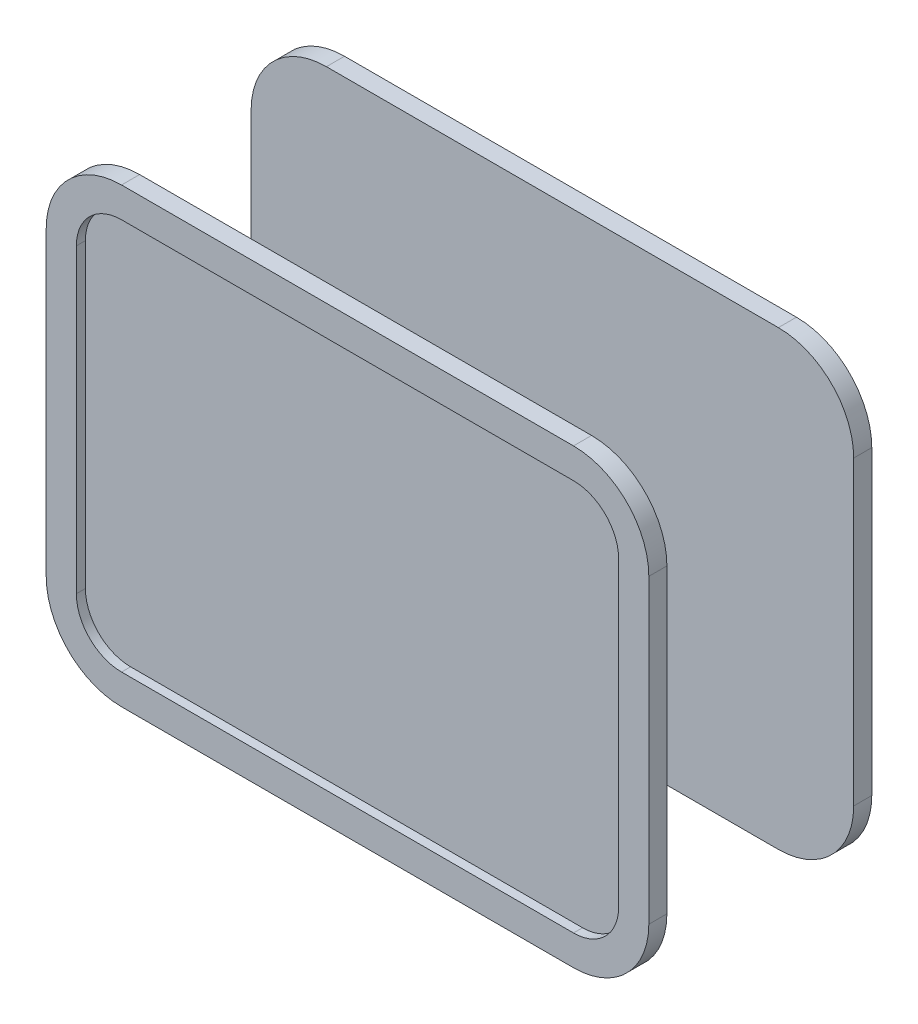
ISO-10303-21;
HEADER;
FILE_DESCRIPTION(('STEP AP214'),'2;1');
FILE_NAME('part.step','',(''),(''),'','','');
FILE_SCHEMA(('AUTOMOTIVE_DESIGN { 1 0 10303 214 1 1 1 1 }'));
ENDSEC;
DATA;
#1=APPLICATION_CONTEXT('core data for automotive mechanical design processes');
#2=APPLICATION_PROTOCOL_DEFINITION('international standard','automotive_design',2000,#1);
#3=PRODUCT_CONTEXT('',#1,'mechanical');
#4=PRODUCT('Part','Part','',(#3));
#5=PRODUCT_RELATED_PRODUCT_CATEGORY('part','',(#4));
#6=PRODUCT_DEFINITION_FORMATION('','',#4);
#7=PRODUCT_DEFINITION_CONTEXT('part definition',#1,'design');
#8=PRODUCT_DEFINITION('design','',#6,#7);
#9=PRODUCT_DEFINITION_SHAPE('','',#8);
#10=(LENGTH_UNIT() NAMED_UNIT(*) SI_UNIT(.MILLI.,.METRE.));
#11=(NAMED_UNIT(*) PLANE_ANGLE_UNIT() SI_UNIT($,.RADIAN.));
#12=(NAMED_UNIT(*) SI_UNIT($,.STERADIAN.) SOLID_ANGLE_UNIT());
#13=UNCERTAINTY_MEASURE_WITH_UNIT(LENGTH_MEASURE(1.E-05),#10,'distance_accuracy_value','');
#14=(GEOMETRIC_REPRESENTATION_CONTEXT(3) GLOBAL_UNCERTAINTY_ASSIGNED_CONTEXT((#13)) GLOBAL_UNIT_ASSIGNED_CONTEXT((#10,
#11,#12)) REPRESENTATION_CONTEXT('',''));
#15=CARTESIAN_POINT('',(0.,0.,0.));
#16=DIRECTION('',(0.,0.,1.));
#17=DIRECTION('',(1.,0.,0.));
#18=AXIS2_PLACEMENT_3D('',#15,#16,#17);
#19=CARTESIAN_POINT('',(115.,-50.,-37.));
#20=DIRECTION('',(0.,0.,-1.));
#21=DIRECTION('',(1.,0.,0.));
#22=AXIS2_PLACEMENT_3D('',#19,#20,#21);
#23=PLANE('',#22);
#24=CARTESIAN_POINT('',(115.,-50.,-37.));
#25=DIRECTION('',(0.,0.,1.));
#26=DIRECTION('',(1.,0.,0.));
#27=AXIS2_PLACEMENT_3D('',#24,#25,#26);
#28=CIRCLE('',#27,25.);
#29=CARTESIAN_POINT('',(115.,-75.,-37.));
#30=VERTEX_POINT('',#29);
#31=CARTESIAN_POINT('',(140.,-50.,-37.));
#32=VERTEX_POINT('',#31);
#33=EDGE_CURVE('E340',#30,#32,#28,.T.);
#34=ORIENTED_EDGE('',*,*,#33,.F.);
#35=DIRECTION('',(1.,0.,0.));
#36=VECTOR('',#35,1.);
#37=CARTESIAN_POINT('',(-34.9999999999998,-75.,-37.));
#38=LINE('',#37,#36);
#39=CARTESIAN_POINT('',(-34.9999999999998,-75.,-37.));
#40=VERTEX_POINT('',#39);
#41=EDGE_CURVE('E343',#40,#30,#38,.T.);
#42=ORIENTED_EDGE('',*,*,#41,.F.);
#43=CARTESIAN_POINT('',(-35.,-50.,-37.));
#44=DIRECTION('',(0.,0.,1.));
#45=DIRECTION('',(1.,0.,0.));
#46=AXIS2_PLACEMENT_3D('',#43,#44,#45);
#47=CIRCLE('',#46,25.);
#48=CARTESIAN_POINT('',(-60.,-49.9999999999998,-37.));
#49=VERTEX_POINT('',#48);
#50=EDGE_CURVE('E347',#49,#40,#47,.T.);
#51=ORIENTED_EDGE('',*,*,#50,.F.);
#52=DIRECTION('',(0.,-1.,0.));
#53=VECTOR('',#52,1.);
#54=CARTESIAN_POINT('',(-60.,49.9999999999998,-37.));
#55=LINE('',#54,#53);
#56=CARTESIAN_POINT('',(-60.,49.9999999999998,-37.));
#57=VERTEX_POINT('',#56);
#58=EDGE_CURVE('E350',#57,#49,#55,.T.);
#59=ORIENTED_EDGE('',*,*,#58,.F.);
#60=CARTESIAN_POINT('',(-35.,50.,-37.));
#61=DIRECTION('',(0.,0.,1.));
#62=DIRECTION('',(1.,0.,0.));
#63=AXIS2_PLACEMENT_3D('',#60,#61,#62);
#64=CIRCLE('',#63,25.);
#65=CARTESIAN_POINT('',(-34.9999999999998,75.,-37.));
#66=VERTEX_POINT('',#65);
#67=EDGE_CURVE('E353',#66,#57,#64,.T.);
#68=ORIENTED_EDGE('',*,*,#67,.F.);
#69=DIRECTION('',(-1.,0.,0.));
#70=VECTOR('',#69,1.);
#71=CARTESIAN_POINT('',(-34.9999999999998,75.,-37.));
#72=LINE('',#71,#70);
#73=CARTESIAN_POINT('',(115.,75.,-37.));
#74=VERTEX_POINT('',#73);
#75=EDGE_CURVE('E356',#74,#66,#72,.T.);
#76=ORIENTED_EDGE('',*,*,#75,.F.);
#77=CARTESIAN_POINT('',(115.,50.,-37.));
#78=DIRECTION('',(0.,0.,1.));
#79=DIRECTION('',(-1.,0.,0.));
#80=AXIS2_PLACEMENT_3D('',#77,#78,#79);
#81=CIRCLE('',#80,25.);
#82=CARTESIAN_POINT('',(140.,50.,-37.));
#83=VERTEX_POINT('',#82);
#84=EDGE_CURVE('E359',#83,#74,#81,.T.);
#85=ORIENTED_EDGE('',*,*,#84,.F.);
#86=DIRECTION('',(0.,1.,0.));
#87=VECTOR('',#86,1.);
#88=CARTESIAN_POINT('',(140.,50.,-37.));
#89=LINE('',#88,#87);
#90=EDGE_CURVE('E362',#32,#83,#89,.T.);
#91=ORIENTED_EDGE('',*,*,#90,.F.);
#92=EDGE_LOOP('',(#34,#42,#51,#59,#68,#76,#85,#91));
#93=FACE_BOUND('',#92,.T.);
#94=DIRECTION('',(1.,0.,0.));
#95=VECTOR('',#94,1.);
#96=CARTESIAN_POINT('',(-34.9999999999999,-65.,-37.));
#97=LINE('',#96,#95);
#98=CARTESIAN_POINT('',(-34.9999999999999,-65.,-37.));
#99=VERTEX_POINT('',#98);
#100=CARTESIAN_POINT('',(115.,-65.,-37.));
#101=VERTEX_POINT('',#100);
#102=EDGE_CURVE('E310',#99,#101,#97,.T.);
#103=ORIENTED_EDGE('',*,*,#102,.T.);
#104=CARTESIAN_POINT('',(115.,-50.,-37.));
#105=DIRECTION('',(0.,0.,1.));
#106=DIRECTION('',(1.,0.,0.));
#107=AXIS2_PLACEMENT_3D('',#104,#105,#106);
#108=CIRCLE('',#107,15.);
#109=CARTESIAN_POINT('',(130.,-50.,-37.));
#110=VERTEX_POINT('',#109);
#111=EDGE_CURVE('E54',#101,#110,#108,.T.);
#112=ORIENTED_EDGE('',*,*,#111,.T.);
#113=DIRECTION('',(0.,1.,0.));
#114=VECTOR('',#113,1.);
#115=CARTESIAN_POINT('',(130.,-50.,-37.));
#116=LINE('',#115,#114);
#117=CARTESIAN_POINT('',(130.,50.,-37.));
#118=VERTEX_POINT('',#117);
#119=EDGE_CURVE('E293',#110,#118,#116,.T.);
#120=ORIENTED_EDGE('',*,*,#119,.T.);
#121=CARTESIAN_POINT('',(115.,50.,-37.));
#122=DIRECTION('',(0.,0.,1.));
#123=DIRECTION('',(1.,0.,0.));
#124=AXIS2_PLACEMENT_3D('',#121,#122,#123);
#125=CIRCLE('',#124,15.);
#126=CARTESIAN_POINT('',(115.,65.,-37.));
#127=VERTEX_POINT('',#126);
#128=EDGE_CURVE('E296',#118,#127,#125,.T.);
#129=ORIENTED_EDGE('',*,*,#128,.T.);
#130=DIRECTION('',(-1.,0.,0.));
#131=VECTOR('',#130,1.);
#132=CARTESIAN_POINT('',(115.,65.,-37.));
#133=LINE('',#132,#131);
#134=CARTESIAN_POINT('',(-34.9999999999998,65.,-37.));
#135=VERTEX_POINT('',#134);
#136=EDGE_CURVE('E321',#127,#135,#133,.T.);
#137=ORIENTED_EDGE('',*,*,#136,.T.);
#138=CARTESIAN_POINT('',(-35.,50.,-37.));
#139=DIRECTION('',(0.,0.,1.));
#140=DIRECTION('',(1.,0.,0.));
#141=AXIS2_PLACEMENT_3D('',#138,#139,#140);
#142=CIRCLE('',#141,15.);
#143=CARTESIAN_POINT('',(-50.,49.9999999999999,-37.));
#144=VERTEX_POINT('',#143);
#145=EDGE_CURVE('E318',#135,#144,#142,.T.);
#146=ORIENTED_EDGE('',*,*,#145,.T.);
#147=DIRECTION('',(0.,-1.,0.));
#148=VECTOR('',#147,1.);
#149=CARTESIAN_POINT('',(-50.,49.9999999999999,-37.));
#150=LINE('',#149,#148);
#151=CARTESIAN_POINT('',(-50.,-49.9999999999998,-37.));
#152=VERTEX_POINT('',#151);
#153=EDGE_CURVE('E315',#144,#152,#150,.T.);
#154=ORIENTED_EDGE('',*,*,#153,.T.);
#155=CARTESIAN_POINT('',(-35.,-50.,-37.));
#156=DIRECTION('',(0.,0.,1.));
#157=DIRECTION('',(1.,0.,0.));
#158=AXIS2_PLACEMENT_3D('',#155,#156,#157);
#159=CIRCLE('',#158,15.);
#160=EDGE_CURVE('E312',#152,#99,#159,.T.);
#161=ORIENTED_EDGE('',*,*,#160,.T.);
#162=EDGE_LOOP('',(#103,#112,#120,#129,#137,#146,#154,#161));
#163=FACE_BOUND('',#162,.T.);
#164=ADVANCED_FACE('F36',(#93,#163),#23,.T.);
#165=CARTESIAN_POINT('',(0.,0.,31.));
#166=DIRECTION('',(0.,0.,-1.));
#167=DIRECTION('',(-1.,0.,0.));
#168=AXIS2_PLACEMENT_3D('',#165,#166,#167);
#169=CYLINDRICAL_SURFACE('',#168,7.);
#170=CARTESIAN_POINT('',(0.,0.,31.));
#171=DIRECTION('',(0.,0.,1.));
#172=DIRECTION('',(1.,0.,0.));
#173=AXIS2_PLACEMENT_3D('',#170,#171,#172);
#174=CIRCLE('',#173,7.);
#175=CARTESIAN_POINT('',(7.,0.,31.));
#176=VERTEX_POINT('',#175);
#177=EDGE_CURVE('E441',#176,#176,#174,.F.);
#178=ORIENTED_EDGE('',*,*,#177,.T.);
#179=EDGE_LOOP('',(#178));
#180=FACE_BOUND('',#179,.T.);
#181=CARTESIAN_POINT('',(0.,0.,11.));
#182=DIRECTION('',(0.,0.,-1.));
#183=DIRECTION('',(-1.,0.,0.));
#184=AXIS2_PLACEMENT_3D('',#181,#182,#183);
#185=CIRCLE('',#184,7.);
#186=CARTESIAN_POINT('',(-7.,0.,11.));
#187=VERTEX_POINT('',#186);
#188=EDGE_CURVE('E11',#187,#187,#185,.T.);
#189=ORIENTED_EDGE('',*,*,#188,.F.);
#190=EDGE_LOOP('',(#189));
#191=FACE_BOUND('',#190,.T.);
#192=ADVANCED_FACE('F611',(#180,#191),#169,.T.);
#193=CARTESIAN_POINT('',(115.,-50.,31.));
#194=DIRECTION('',(0.,0.,1.));
#195=DIRECTION('',(1.,0.,0.));
#196=AXIS2_PLACEMENT_3D('',#193,#194,#195);
#197=PLANE('',#196);
#198=CARTESIAN_POINT('',(115.,-50.,31.));
#199=DIRECTION('',(0.,0.,1.));
#200=DIRECTION('',(1.,0.,0.));
#201=AXIS2_PLACEMENT_3D('',#198,#199,#200);
#202=CIRCLE('',#201,25.);
#203=CARTESIAN_POINT('',(115.,-75.,31.));
#204=VERTEX_POINT('',#203);
#205=CARTESIAN_POINT('',(140.,-50.,31.));
#206=VERTEX_POINT('',#205);
#207=EDGE_CURVE('E513',#204,#206,#202,.T.);
#208=ORIENTED_EDGE('',*,*,#207,.F.);
#209=DIRECTION('',(1.,0.,0.));
#210=VECTOR('',#209,1.);
#211=CARTESIAN_POINT('',(-34.9999999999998,-75.,31.));
#212=LINE('',#211,#210);
#213=CARTESIAN_POINT('',(-34.9999999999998,-75.,31.));
#214=VERTEX_POINT('',#213);
#215=EDGE_CURVE('E531',#214,#204,#212,.T.);
#216=ORIENTED_EDGE('',*,*,#215,.F.);
#217=CARTESIAN_POINT('',(-35.,-50.,31.));
#218=DIRECTION('',(0.,0.,1.));
#219=DIRECTION('',(1.,0.,0.));
#220=AXIS2_PLACEMENT_3D('',#217,#218,#219);
#221=CIRCLE('',#220,25.);
#222=CARTESIAN_POINT('',(-60.,-49.9999999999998,31.));
#223=VERTEX_POINT('',#222);
#224=EDGE_CURVE('E558',#223,#214,#221,.T.);
#225=ORIENTED_EDGE('',*,*,#224,.F.);
#226=DIRECTION('',(0.,-1.,0.));
#227=VECTOR('',#226,1.);
#228=CARTESIAN_POINT('',(-60.,49.9999999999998,31.));
#229=LINE('',#228,#227);
#230=CARTESIAN_POINT('',(-60.,49.9999999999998,31.));
#231=VERTEX_POINT('',#230);
#232=EDGE_CURVE('E556',#231,#223,#229,.T.);
#233=ORIENTED_EDGE('',*,*,#232,.F.);
#234=CARTESIAN_POINT('',(-35.,50.,31.));
#235=DIRECTION('',(0.,0.,1.));
#236=DIRECTION('',(1.,0.,0.));
#237=AXIS2_PLACEMENT_3D('',#234,#235,#236);
#238=CIRCLE('',#237,25.);
#239=CARTESIAN_POINT('',(-34.9999999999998,75.,31.));
#240=VERTEX_POINT('',#239);
#241=EDGE_CURVE('E554',#240,#231,#238,.T.);
#242=ORIENTED_EDGE('',*,*,#241,.F.);
#243=DIRECTION('',(-1.,0.,0.));
#244=VECTOR('',#243,1.);
#245=CARTESIAN_POINT('',(-34.9999999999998,75.,31.));
#246=LINE('',#245,#244);
#247=CARTESIAN_POINT('',(115.,75.,31.));
#248=VERTEX_POINT('',#247);
#249=EDGE_CURVE('E552',#248,#240,#246,.T.);
#250=ORIENTED_EDGE('',*,*,#249,.F.);
#251=CARTESIAN_POINT('',(115.,50.,31.));
#252=DIRECTION('',(0.,0.,1.));
#253=DIRECTION('',(-1.,0.,0.));
#254=AXIS2_PLACEMENT_3D('',#251,#252,#253);
#255=CIRCLE('',#254,25.);
#256=CARTESIAN_POINT('',(140.,50.,31.));
#257=VERTEX_POINT('',#256);
#258=EDGE_CURVE('E550',#257,#248,#255,.T.);
#259=ORIENTED_EDGE('',*,*,#258,.F.);
#260=DIRECTION('',(0.,1.,0.));
#261=VECTOR('',#260,1.);
#262=CARTESIAN_POINT('',(140.,50.,31.));
#263=LINE('',#262,#261);
#264=EDGE_CURVE('E548',#206,#257,#263,.T.);
#265=ORIENTED_EDGE('',*,*,#264,.F.);
#266=EDGE_LOOP('',(#208,#216,#225,#233,#242,#250,#259,#265));
#267=FACE_BOUND('',#266,.T.);
#268=ORIENTED_EDGE('',*,*,#177,.F.);
#269=EDGE_LOOP('',(#268));
#270=FACE_BOUND('',#269,.T.);
#271=ADVANCED_FACE('F628',(#267,#270),#197,.F.);
#272=CARTESIAN_POINT('',(115.,-50.,37.));
#273=DIRECTION('',(0.,0.,-1.));
#274=DIRECTION('',(-1.,0.,0.));
#275=AXIS2_PLACEMENT_3D('',#272,#273,#274);
#276=CYLINDRICAL_SURFACE('',#275,25.);
#277=ORIENTED_EDGE('',*,*,#207,.T.);
#278=DIRECTION('',(0.,0.,-1.));
#279=VECTOR('',#278,1.);
#280=CARTESIAN_POINT('',(140.,-50.,37.));
#281=LINE('',#280,#279);
#282=CARTESIAN_POINT('',(140.,-50.,37.));
#283=VERTEX_POINT('',#282);
#284=EDGE_CURVE('E581',#283,#206,#281,.T.);
#285=ORIENTED_EDGE('',*,*,#284,.F.);
#286=CARTESIAN_POINT('',(115.,-50.,37.));
#287=DIRECTION('',(0.,0.,1.));
#288=DIRECTION('',(1.,0.,0.));
#289=AXIS2_PLACEMENT_3D('',#286,#287,#288);
#290=CIRCLE('',#289,25.);
#291=CARTESIAN_POINT('',(115.,-75.,37.));
#292=VERTEX_POINT('',#291);
#293=EDGE_CURVE('E527',#292,#283,#290,.T.);
#294=ORIENTED_EDGE('',*,*,#293,.F.);
#295=DIRECTION('',(0.,0.,-1.));
#296=VECTOR('',#295,1.);
#297=CARTESIAN_POINT('',(115.,-75.,37.));
#298=LINE('',#297,#296);
#299=EDGE_CURVE('E545',#292,#204,#298,.T.);
#300=ORIENTED_EDGE('',*,*,#299,.T.);
#301=EDGE_LOOP('',(#277,#285,#294,#300));
#302=FACE_BOUND('',#301,.T.);
#303=ADVANCED_FACE('F38',(#302),#276,.T.);
#304=CARTESIAN_POINT('',(140.,50.,37.));
#305=DIRECTION('',(-1.,0.,0.));
#306=DIRECTION('',(0.,0.,1.));
#307=AXIS2_PLACEMENT_3D('',#304,#305,#306);
#308=PLANE('',#307);
#309=ORIENTED_EDGE('',*,*,#264,.T.);
#310=DIRECTION('',(0.,0.,-1.));
#311=VECTOR('',#310,1.);
#312=CARTESIAN_POINT('',(140.,50.,37.));
#313=LINE('',#312,#311);
#314=CARTESIAN_POINT('',(140.,50.,37.));
#315=VERTEX_POINT('',#314);
#316=EDGE_CURVE('E578',#315,#257,#313,.T.);
#317=ORIENTED_EDGE('',*,*,#316,.F.);
#318=DIRECTION('',(0.,1.,0.));
#319=VECTOR('',#318,1.);
#320=CARTESIAN_POINT('',(140.,50.,37.));
#321=LINE('',#320,#319);
#322=EDGE_CURVE('E530',#283,#315,#321,.T.);
#323=ORIENTED_EDGE('',*,*,#322,.F.);
#324=ORIENTED_EDGE('',*,*,#284,.T.);
#325=EDGE_LOOP('',(#309,#317,#323,#324));
#326=FACE_BOUND('',#325,.T.);
#327=ADVANCED_FACE('F772',(#326),#308,.F.);
#328=CARTESIAN_POINT('',(115.,50.,37.));
#329=DIRECTION('',(0.,0.,-1.));
#330=DIRECTION('',(-1.,0.,0.));
#331=AXIS2_PLACEMENT_3D('',#328,#329,#330);
#332=CYLINDRICAL_SURFACE('',#331,25.);
#333=ORIENTED_EDGE('',*,*,#258,.T.);
#334=DIRECTION('',(0.,0.,-1.));
#335=VECTOR('',#334,1.);
#336=CARTESIAN_POINT('',(115.,75.,37.));
#337=LINE('',#336,#335);
#338=CARTESIAN_POINT('',(115.,75.,37.));
#339=VERTEX_POINT('',#338);
#340=EDGE_CURVE('E575',#339,#248,#337,.T.);
#341=ORIENTED_EDGE('',*,*,#340,.F.);
#342=CARTESIAN_POINT('',(115.,50.,37.));
#343=DIRECTION('',(0.,0.,1.));
#344=DIRECTION('',(-1.,0.,0.));
#345=AXIS2_PLACEMENT_3D('',#342,#343,#344);
#346=CIRCLE('',#345,25.);
#347=EDGE_CURVE('E533',#315,#339,#346,.T.);
#348=ORIENTED_EDGE('',*,*,#347,.F.);
#349=ORIENTED_EDGE('',*,*,#316,.T.);
#350=EDGE_LOOP('',(#333,#341,#348,#349));
#351=FACE_BOUND('',#350,.T.);
#352=ADVANCED_FACE('F769',(#351),#332,.T.);
#353=CARTESIAN_POINT('',(-34.9999999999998,75.,37.));
#354=DIRECTION('',(0.,-1.,0.));
#355=DIRECTION('',(1.,0.,0.));
#356=AXIS2_PLACEMENT_3D('',#353,#354,#355);
#357=PLANE('',#356);
#358=ORIENTED_EDGE('',*,*,#249,.T.);
#359=DIRECTION('',(0.,0.,-1.));
#360=VECTOR('',#359,1.);
#361=CARTESIAN_POINT('',(-34.9999999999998,75.,37.));
#362=LINE('',#361,#360);
#363=CARTESIAN_POINT('',(-34.9999999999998,75.,37.));
#364=VERTEX_POINT('',#363);
#365=EDGE_CURVE('E572',#364,#240,#362,.T.);
#366=ORIENTED_EDGE('',*,*,#365,.F.);
#367=DIRECTION('',(-1.,0.,0.));
#368=VECTOR('',#367,1.);
#369=CARTESIAN_POINT('',(-34.9999999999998,75.,37.));
#370=LINE('',#369,#368);
#371=EDGE_CURVE('E535',#339,#364,#370,.T.);
#372=ORIENTED_EDGE('',*,*,#371,.F.);
#373=ORIENTED_EDGE('',*,*,#340,.T.);
#374=EDGE_LOOP('',(#358,#366,#372,#373));
#375=FACE_BOUND('',#374,.T.);
#376=ADVANCED_FACE('F765',(#375),#357,.F.);
#377=CARTESIAN_POINT('',(-35.,50.,37.));
#378=DIRECTION('',(0.,0.,-1.));
#379=DIRECTION('',(-1.,0.,0.));
#380=AXIS2_PLACEMENT_3D('',#377,#378,#379);
#381=CYLINDRICAL_SURFACE('',#380,25.);
#382=ORIENTED_EDGE('',*,*,#241,.T.);
#383=DIRECTION('',(0.,0.,-1.));
#384=VECTOR('',#383,1.);
#385=CARTESIAN_POINT('',(-60.,49.9999999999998,37.));
#386=LINE('',#385,#384);
#387=CARTESIAN_POINT('',(-60.,49.9999999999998,37.));
#388=VERTEX_POINT('',#387);
#389=EDGE_CURVE('E569',#388,#231,#386,.T.);
#390=ORIENTED_EDGE('',*,*,#389,.F.);
#391=CARTESIAN_POINT('',(-35.,50.,37.));
#392=DIRECTION('',(0.,0.,1.));
#393=DIRECTION('',(1.,0.,0.));
#394=AXIS2_PLACEMENT_3D('',#391,#392,#393);
#395=CIRCLE('',#394,25.);
#396=EDGE_CURVE('E537',#364,#388,#395,.T.);
#397=ORIENTED_EDGE('',*,*,#396,.F.);
#398=ORIENTED_EDGE('',*,*,#365,.T.);
#399=EDGE_LOOP('',(#382,#390,#397,#398));
#400=FACE_BOUND('',#399,.T.);
#401=ADVANCED_FACE('F761',(#400),#381,.T.);
#402=CARTESIAN_POINT('',(-60.,49.9999999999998,37.));
#403=DIRECTION('',(1.,0.,0.));
#404=DIRECTION('',(0.,1.,0.));
#405=AXIS2_PLACEMENT_3D('',#402,#403,#404);
#406=PLANE('',#405);
#407=ORIENTED_EDGE('',*,*,#232,.T.);
#408=DIRECTION('',(0.,0.,-1.));
#409=VECTOR('',#408,1.);
#410=CARTESIAN_POINT('',(-60.,-49.9999999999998,37.));
#411=LINE('',#410,#409);
#412=CARTESIAN_POINT('',(-60.,-49.9999999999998,37.));
#413=VERTEX_POINT('',#412);
#414=EDGE_CURVE('E566',#413,#223,#411,.T.);
#415=ORIENTED_EDGE('',*,*,#414,.F.);
#416=DIRECTION('',(0.,-1.,0.));
#417=VECTOR('',#416,1.);
#418=CARTESIAN_POINT('',(-60.,49.9999999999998,37.));
#419=LINE('',#418,#417);
#420=EDGE_CURVE('E539',#388,#413,#419,.T.);
#421=ORIENTED_EDGE('',*,*,#420,.F.);
#422=ORIENTED_EDGE('',*,*,#389,.T.);
#423=EDGE_LOOP('',(#407,#415,#421,#422));
#424=FACE_BOUND('',#423,.T.);
#425=ADVANCED_FACE('F757',(#424),#406,.F.);
#426=CARTESIAN_POINT('',(-35.,-50.,37.));
#427=DIRECTION('',(0.,0.,-1.));
#428=DIRECTION('',(-1.,0.,0.));
#429=AXIS2_PLACEMENT_3D('',#426,#427,#428);
#430=CYLINDRICAL_SURFACE('',#429,25.);
#431=ORIENTED_EDGE('',*,*,#224,.T.);
#432=DIRECTION('',(0.,0.,-1.));
#433=VECTOR('',#432,1.);
#434=CARTESIAN_POINT('',(-34.9999999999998,-75.,37.));
#435=LINE('',#434,#433);
#436=CARTESIAN_POINT('',(-34.9999999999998,-75.,37.));
#437=VERTEX_POINT('',#436);
#438=EDGE_CURVE('E563',#437,#214,#435,.T.);
#439=ORIENTED_EDGE('',*,*,#438,.F.);
#440=CARTESIAN_POINT('',(-35.,-50.,37.));
#441=DIRECTION('',(0.,0.,1.));
#442=DIRECTION('',(1.,0.,0.));
#443=AXIS2_PLACEMENT_3D('',#440,#441,#442);
#444=CIRCLE('',#443,25.);
#445=EDGE_CURVE('E541',#413,#437,#444,.T.);
#446=ORIENTED_EDGE('',*,*,#445,.F.);
#447=ORIENTED_EDGE('',*,*,#414,.T.);
#448=EDGE_LOOP('',(#431,#439,#446,#447));
#449=FACE_BOUND('',#448,.T.);
#450=ADVANCED_FACE('F753',(#449),#430,.T.);
#451=CARTESIAN_POINT('',(-34.9999999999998,-75.,37.));
#452=DIRECTION('',(0.,1.,0.));
#453=DIRECTION('',(-1.,0.,0.));
#454=AXIS2_PLACEMENT_3D('',#451,#452,#453);
#455=PLANE('',#454);
#456=ORIENTED_EDGE('',*,*,#215,.T.);
#457=ORIENTED_EDGE('',*,*,#299,.F.);
#458=DIRECTION('',(1.,0.,0.));
#459=VECTOR('',#458,1.);
#460=CARTESIAN_POINT('',(-34.9999999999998,-75.,37.));
#461=LINE('',#460,#459);
#462=EDGE_CURVE('E543',#437,#292,#461,.T.);
#463=ORIENTED_EDGE('',*,*,#462,.F.);
#464=ORIENTED_EDGE('',*,*,#438,.T.);
#465=EDGE_LOOP('',(#456,#457,#463,#464));
#466=FACE_BOUND('',#465,.T.);
#467=ADVANCED_FACE('F748',(#466),#455,.F.);
#468=CARTESIAN_POINT('',(115.,-50.,37.));
#469=DIRECTION('',(0.,0.,1.));
#470=DIRECTION('',(1.,0.,0.));
#471=AXIS2_PLACEMENT_3D('',#468,#469,#470);
#472=PLANE('',#471);
#473=CARTESIAN_POINT('',(115.,-50.,37.));
#474=DIRECTION('',(0.,0.,1.));
#475=DIRECTION('',(1.,0.,0.));
#476=AXIS2_PLACEMENT_3D('',#473,#474,#475);
#477=CIRCLE('',#476,15.);
#478=CARTESIAN_POINT('',(115.,-65.,37.));
#479=VERTEX_POINT('',#478);
#480=CARTESIAN_POINT('',(130.,-50.,37.));
#481=VERTEX_POINT('',#480);
#482=EDGE_CURVE('E62',#479,#481,#477,.T.);
#483=ORIENTED_EDGE('',*,*,#482,.F.);
#484=DIRECTION('',(1.,0.,0.));
#485=VECTOR('',#484,1.);
#486=CARTESIAN_POINT('',(-34.9999999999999,-65.,37.));
#487=LINE('',#486,#485);
#488=CARTESIAN_POINT('',(-34.9999999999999,-65.,37.));
#489=VERTEX_POINT('',#488);
#490=EDGE_CURVE('E468',#489,#479,#487,.T.);
#491=ORIENTED_EDGE('',*,*,#490,.F.);
#492=CARTESIAN_POINT('',(-35.,-50.,37.));
#493=DIRECTION('',(0.,0.,1.));
#494=DIRECTION('',(1.,0.,0.));
#495=AXIS2_PLACEMENT_3D('',#492,#493,#494);
#496=CIRCLE('',#495,15.);
#497=CARTESIAN_POINT('',(-50.,-49.9999999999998,37.));
#498=VERTEX_POINT('',#497);
#499=EDGE_CURVE('E506',#498,#489,#496,.T.);
#500=ORIENTED_EDGE('',*,*,#499,.F.);
#501=DIRECTION('',(0.,-1.,0.));
#502=VECTOR('',#501,1.);
#503=CARTESIAN_POINT('',(-50.,49.9999999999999,37.));
#504=LINE('',#503,#502);
#505=CARTESIAN_POINT('',(-50.,49.9999999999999,37.));
#506=VERTEX_POINT('',#505);
#507=EDGE_CURVE('E503',#506,#498,#504,.T.);
#508=ORIENTED_EDGE('',*,*,#507,.F.);
#509=CARTESIAN_POINT('',(-35.,50.,37.));
#510=DIRECTION('',(0.,0.,1.));
#511=DIRECTION('',(1.,0.,0.));
#512=AXIS2_PLACEMENT_3D('',#509,#510,#511);
#513=CIRCLE('',#512,15.);
#514=CARTESIAN_POINT('',(-34.9999999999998,65.,37.));
#515=VERTEX_POINT('',#514);
#516=EDGE_CURVE('E500',#515,#506,#513,.T.);
#517=ORIENTED_EDGE('',*,*,#516,.F.);
#518=DIRECTION('',(-1.,0.,0.));
#519=VECTOR('',#518,1.);
#520=CARTESIAN_POINT('',(115.,65.,37.));
#521=LINE('',#520,#519);
#522=CARTESIAN_POINT('',(115.,65.,37.));
#523=VERTEX_POINT('',#522);
#524=EDGE_CURVE('E497',#523,#515,#521,.T.);
#525=ORIENTED_EDGE('',*,*,#524,.F.);
#526=CARTESIAN_POINT('',(115.,50.,37.));
#527=DIRECTION('',(0.,0.,1.));
#528=DIRECTION('',(1.,0.,0.));
#529=AXIS2_PLACEMENT_3D('',#526,#527,#528);
#530=CIRCLE('',#529,15.);
#531=CARTESIAN_POINT('',(130.,50.,37.));
#532=VERTEX_POINT('',#531);
#533=EDGE_CURVE('E494',#532,#523,#530,.T.);
#534=ORIENTED_EDGE('',*,*,#533,.F.);
#535=DIRECTION('',(0.,1.,0.));
#536=VECTOR('',#535,1.);
#537=CARTESIAN_POINT('',(130.,-50.,37.));
#538=LINE('',#537,#536);
#539=EDGE_CURVE('E491',#481,#532,#538,.T.);
#540=ORIENTED_EDGE('',*,*,#539,.F.);
#541=EDGE_LOOP('',(#483,#491,#500,#508,#517,#525,#534,#540));
#542=FACE_BOUND('',#541,.T.);
#543=ORIENTED_EDGE('',*,*,#293,.T.);
#544=ORIENTED_EDGE('',*,*,#322,.T.);
#545=ORIENTED_EDGE('',*,*,#347,.T.);
#546=ORIENTED_EDGE('',*,*,#371,.T.);
#547=ORIENTED_EDGE('',*,*,#396,.T.);
#548=ORIENTED_EDGE('',*,*,#420,.T.);
#549=ORIENTED_EDGE('',*,*,#445,.T.);
#550=ORIENTED_EDGE('',*,*,#462,.T.);
#551=EDGE_LOOP('',(#543,#544,#545,#546,#547,#548,#549,#550));
#552=FACE_BOUND('',#551,.T.);
#553=ADVANCED_FACE('F746',(#542,#552),#472,.T.);
#554=CARTESIAN_POINT('',(115.,-50.,34.));
#555=DIRECTION('',(0.,0.,1.));
#556=DIRECTION('',(1.,0.,0.));
#557=AXIS2_PLACEMENT_3D('',#554,#555,#556);
#558=CYLINDRICAL_SURFACE('',#557,15.);
#559=ORIENTED_EDGE('',*,*,#482,.T.);
#560=DIRECTION('',(0.,0.,1.));
#561=VECTOR('',#560,1.);
#562=CARTESIAN_POINT('',(130.,-50.,34.));
#563=LINE('',#562,#561);
#564=CARTESIAN_POINT('',(130.,-50.,34.));
#565=VERTEX_POINT('',#564);
#566=EDGE_CURVE('E489',#565,#481,#563,.T.);
#567=ORIENTED_EDGE('',*,*,#566,.F.);
#568=CARTESIAN_POINT('',(115.,-50.,34.));
#569=DIRECTION('',(0.,0.,1.));
#570=DIRECTION('',(1.,0.,0.));
#571=AXIS2_PLACEMENT_3D('',#568,#569,#570);
#572=CIRCLE('',#571,15.);
#573=CARTESIAN_POINT('',(115.,-65.,34.));
#574=VERTEX_POINT('',#573);
#575=EDGE_CURVE('E464',#574,#565,#572,.T.);
#576=ORIENTED_EDGE('',*,*,#575,.F.);
#577=DIRECTION('',(0.,0.,1.));
#578=VECTOR('',#577,1.);
#579=CARTESIAN_POINT('',(115.,-65.,34.));
#580=LINE('',#579,#578);
#581=EDGE_CURVE('E511',#574,#479,#580,.T.);
#582=ORIENTED_EDGE('',*,*,#581,.T.);
#583=EDGE_LOOP('',(#559,#567,#576,#582));
#584=FACE_BOUND('',#583,.T.);
#585=ADVANCED_FACE('F720',(#584),#558,.F.);
#586=CARTESIAN_POINT('',(-34.9999999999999,-65.,34.));
#587=DIRECTION('',(0.,-1.,0.));
#588=DIRECTION('',(1.,0.,0.));
#589=AXIS2_PLACEMENT_3D('',#586,#587,#588);
#590=PLANE('',#589);
#591=ORIENTED_EDGE('',*,*,#490,.T.);
#592=ORIENTED_EDGE('',*,*,#581,.F.);
#593=DIRECTION('',(1.,0.,0.));
#594=VECTOR('',#593,1.);
#595=CARTESIAN_POINT('',(-34.9999999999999,-65.,34.));
#596=LINE('',#595,#594);
#597=CARTESIAN_POINT('',(-34.9999999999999,-65.,34.));
#598=VERTEX_POINT('',#597);
#599=EDGE_CURVE('E486',#598,#574,#596,.T.);
#600=ORIENTED_EDGE('',*,*,#599,.F.);
#601=DIRECTION('',(0.,0.,1.));
#602=VECTOR('',#601,1.);
#603=CARTESIAN_POINT('',(-34.9999999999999,-65.,34.));
#604=LINE('',#603,#602);
#605=EDGE_CURVE('E514',#598,#489,#604,.T.);
#606=ORIENTED_EDGE('',*,*,#605,.T.);
#607=EDGE_LOOP('',(#591,#592,#600,#606));
#608=FACE_BOUND('',#607,.T.);
#609=ADVANCED_FACE('F716',(#608),#590,.F.);
#610=CARTESIAN_POINT('',(-35.,-50.,34.));
#611=DIRECTION('',(0.,0.,1.));
#612=DIRECTION('',(1.,0.,0.));
#613=AXIS2_PLACEMENT_3D('',#610,#611,#612);
#614=CYLINDRICAL_SURFACE('',#613,15.);
#615=ORIENTED_EDGE('',*,*,#499,.T.);
#616=ORIENTED_EDGE('',*,*,#605,.F.);
#617=CARTESIAN_POINT('',(-35.,-50.,34.));
#618=DIRECTION('',(0.,0.,1.));
#619=DIRECTION('',(1.,0.,0.));
#620=AXIS2_PLACEMENT_3D('',#617,#618,#619);
#621=CIRCLE('',#620,15.);
#622=CARTESIAN_POINT('',(-50.,-49.9999999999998,34.));
#623=VERTEX_POINT('',#622);
#624=EDGE_CURVE('E483',#623,#598,#621,.T.);
#625=ORIENTED_EDGE('',*,*,#624,.F.);
#626=DIRECTION('',(0.,0.,1.));
#627=VECTOR('',#626,1.);
#628=CARTESIAN_POINT('',(-50.,-49.9999999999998,34.));
#629=LINE('',#628,#627);
#630=EDGE_CURVE('E516',#623,#498,#629,.T.);
#631=ORIENTED_EDGE('',*,*,#630,.T.);
#632=EDGE_LOOP('',(#615,#616,#625,#631));
#633=FACE_BOUND('',#632,.T.);
#634=ADVANCED_FACE('F719',(#633),#614,.F.);
#635=CARTESIAN_POINT('',(-50.,49.9999999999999,34.));
#636=DIRECTION('',(-1.,0.,0.));
#637=DIRECTION('',(0.,-1.,0.));
#638=AXIS2_PLACEMENT_3D('',#635,#636,#637);
#639=PLANE('',#638);
#640=ORIENTED_EDGE('',*,*,#507,.T.);
#641=ORIENTED_EDGE('',*,*,#630,.F.);
#642=DIRECTION('',(0.,-1.,0.));
#643=VECTOR('',#642,1.);
#644=CARTESIAN_POINT('',(-50.,49.9999999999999,34.));
#645=LINE('',#644,#643);
#646=CARTESIAN_POINT('',(-50.,49.9999999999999,34.));
#647=VERTEX_POINT('',#646);
#648=EDGE_CURVE('E480',#647,#623,#645,.T.);
#649=ORIENTED_EDGE('',*,*,#648,.F.);
#650=DIRECTION('',(0.,0.,1.));
#651=VECTOR('',#650,1.);
#652=CARTESIAN_POINT('',(-50.,49.9999999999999,34.));
#653=LINE('',#652,#651);
#654=EDGE_CURVE('E518',#647,#506,#653,.T.);
#655=ORIENTED_EDGE('',*,*,#654,.T.);
#656=EDGE_LOOP('',(#640,#641,#649,#655));
#657=FACE_BOUND('',#656,.T.);
#658=ADVANCED_FACE('F724',(#657),#639,.F.);
#659=CARTESIAN_POINT('',(-35.,50.,34.));
#660=DIRECTION('',(0.,0.,1.));
#661=DIRECTION('',(1.,0.,0.));
#662=AXIS2_PLACEMENT_3D('',#659,#660,#661);
#663=CYLINDRICAL_SURFACE('',#662,15.);
#664=ORIENTED_EDGE('',*,*,#516,.T.);
#665=ORIENTED_EDGE('',*,*,#654,.F.);
#666=CARTESIAN_POINT('',(-35.,50.,34.));
#667=DIRECTION('',(0.,0.,1.));
#668=DIRECTION('',(1.,0.,0.));
#669=AXIS2_PLACEMENT_3D('',#666,#667,#668);
#670=CIRCLE('',#669,15.);
#671=CARTESIAN_POINT('',(-34.9999999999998,65.,34.));
#672=VERTEX_POINT('',#671);
#673=EDGE_CURVE('E477',#672,#647,#670,.T.);
#674=ORIENTED_EDGE('',*,*,#673,.F.);
#675=DIRECTION('',(0.,0.,1.));
#676=VECTOR('',#675,1.);
#677=CARTESIAN_POINT('',(-34.9999999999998,65.,34.));
#678=LINE('',#677,#676);
#679=EDGE_CURVE('E520',#672,#515,#678,.T.);
#680=ORIENTED_EDGE('',*,*,#679,.T.);
#681=EDGE_LOOP('',(#664,#665,#674,#680));
#682=FACE_BOUND('',#681,.T.);
#683=ADVANCED_FACE('F728',(#682),#663,.F.);
#684=CARTESIAN_POINT('',(115.,65.,34.));
#685=DIRECTION('',(0.,1.,0.));
#686=DIRECTION('',(-1.,0.,0.));
#687=AXIS2_PLACEMENT_3D('',#684,#685,#686);
#688=PLANE('',#687);
#689=ORIENTED_EDGE('',*,*,#524,.T.);
#690=ORIENTED_EDGE('',*,*,#679,.F.);
#691=DIRECTION('',(-1.,0.,0.));
#692=VECTOR('',#691,1.);
#693=CARTESIAN_POINT('',(115.,65.,34.));
#694=LINE('',#693,#692);
#695=CARTESIAN_POINT('',(115.,65.,34.));
#696=VERTEX_POINT('',#695);
#697=EDGE_CURVE('E474',#696,#672,#694,.T.);
#698=ORIENTED_EDGE('',*,*,#697,.F.);
#699=DIRECTION('',(0.,0.,1.));
#700=VECTOR('',#699,1.);
#701=CARTESIAN_POINT('',(115.,65.,34.));
#702=LINE('',#701,#700);
#703=EDGE_CURVE('E522',#696,#523,#702,.T.);
#704=ORIENTED_EDGE('',*,*,#703,.T.);
#705=EDGE_LOOP('',(#689,#690,#698,#704));
#706=FACE_BOUND('',#705,.T.);
#707=ADVANCED_FACE('F732',(#706),#688,.F.);
#708=CARTESIAN_POINT('',(115.,50.,34.));
#709=DIRECTION('',(0.,0.,1.));
#710=DIRECTION('',(1.,0.,0.));
#711=AXIS2_PLACEMENT_3D('',#708,#709,#710);
#712=CYLINDRICAL_SURFACE('',#711,15.);
#713=ORIENTED_EDGE('',*,*,#533,.T.);
#714=ORIENTED_EDGE('',*,*,#703,.F.);
#715=CARTESIAN_POINT('',(115.,50.,34.));
#716=DIRECTION('',(0.,0.,1.));
#717=DIRECTION('',(1.,0.,0.));
#718=AXIS2_PLACEMENT_3D('',#715,#716,#717);
#719=CIRCLE('',#718,15.);
#720=CARTESIAN_POINT('',(130.,50.,34.));
#721=VERTEX_POINT('',#720);
#722=EDGE_CURVE('E471',#721,#696,#719,.T.);
#723=ORIENTED_EDGE('',*,*,#722,.F.);
#724=DIRECTION('',(0.,0.,1.));
#725=VECTOR('',#724,1.);
#726=CARTESIAN_POINT('',(130.,50.,34.));
#727=LINE('',#726,#725);
#728=EDGE_CURVE('E524',#721,#532,#727,.T.);
#729=ORIENTED_EDGE('',*,*,#728,.T.);
#730=EDGE_LOOP('',(#713,#714,#723,#729));
#731=FACE_BOUND('',#730,.T.);
#732=ADVANCED_FACE('F736',(#731),#712,.F.);
#733=CARTESIAN_POINT('',(130.,-50.,34.));
#734=DIRECTION('',(1.,0.,0.));
#735=DIRECTION('',(0.,0.,-1.));
#736=AXIS2_PLACEMENT_3D('',#733,#734,#735);
#737=PLANE('',#736);
#738=ORIENTED_EDGE('',*,*,#539,.T.);
#739=ORIENTED_EDGE('',*,*,#728,.F.);
#740=DIRECTION('',(0.,1.,0.));
#741=VECTOR('',#740,1.);
#742=CARTESIAN_POINT('',(130.,-50.,34.));
#743=LINE('',#742,#741);
#744=EDGE_CURVE('E467',#565,#721,#743,.T.);
#745=ORIENTED_EDGE('',*,*,#744,.F.);
#746=ORIENTED_EDGE('',*,*,#566,.T.);
#747=EDGE_LOOP('',(#738,#739,#745,#746));
#748=FACE_BOUND('',#747,.T.);
#749=ADVANCED_FACE('F714',(#748),#737,.F.);
#750=CARTESIAN_POINT('',(115.,-50.,34.));
#751=DIRECTION('',(0.,0.,1.));
#752=DIRECTION('',(1.,0.,0.));
#753=AXIS2_PLACEMENT_3D('',#750,#751,#752);
#754=PLANE('',#753);
#755=ORIENTED_EDGE('',*,*,#575,.T.);
#756=ORIENTED_EDGE('',*,*,#744,.T.);
#757=ORIENTED_EDGE('',*,*,#722,.T.);
#758=ORIENTED_EDGE('',*,*,#697,.T.);
#759=ORIENTED_EDGE('',*,*,#673,.T.);
#760=ORIENTED_EDGE('',*,*,#648,.T.);
#761=ORIENTED_EDGE('',*,*,#624,.T.);
#762=ORIENTED_EDGE('',*,*,#599,.T.);
#763=EDGE_LOOP('',(#755,#756,#757,#758,#759,#760,#761,#762));
#764=FACE_BOUND('',#763,.T.);
#765=ADVANCED_FACE('F680',(#764),#754,.T.);
#766=CARTESIAN_POINT('',(-11.,-11.,11.));
#767=DIRECTION('',(0.,1.,0.));
#768=DIRECTION('',(0.,0.,1.));
#769=AXIS2_PLACEMENT_3D('',#766,#767,#768);
#770=PLANE('',#769);
#771=DIRECTION('',(0.,0.,1.));
#772=VECTOR('',#771,1.);
#773=CARTESIAN_POINT('',(-11.,-11.,-11.));
#774=LINE('',#773,#772);
#775=CARTESIAN_POINT('',(-11.,-11.,-11.));
#776=VERTEX_POINT('',#775);
#777=CARTESIAN_POINT('',(-11.,-11.,11.));
#778=VERTEX_POINT('',#777);
#779=EDGE_CURVE('E406',#776,#778,#774,.T.);
#780=ORIENTED_EDGE('',*,*,#779,.F.);
#781=DIRECTION('',(-1.,0.,0.));
#782=VECTOR('',#781,1.);
#783=CARTESIAN_POINT('',(-11.,-11.,-11.));
#784=LINE('',#783,#782);
#785=CARTESIAN_POINT('',(11.,-11.,-11.));
#786=VERTEX_POINT('',#785);
#787=EDGE_CURVE('E411',#786,#776,#784,.T.);
#788=ORIENTED_EDGE('',*,*,#787,.F.);
#789=DIRECTION('',(0.,0.,-1.));
#790=VECTOR('',#789,1.);
#791=CARTESIAN_POINT('',(11.,-11.,-11.));
#792=LINE('',#791,#790);
#793=CARTESIAN_POINT('',(11.,-11.,11.));
#794=VERTEX_POINT('',#793);
#795=EDGE_CURVE('E422',#794,#786,#792,.T.);
#796=ORIENTED_EDGE('',*,*,#795,.F.);
#797=DIRECTION('',(1.,0.,0.));
#798=VECTOR('',#797,1.);
#799=CARTESIAN_POINT('',(-11.,-11.,11.));
#800=LINE('',#799,#798);
#801=EDGE_CURVE('E420',#778,#794,#800,.T.);
#802=ORIENTED_EDGE('',*,*,#801,.F.);
#803=EDGE_LOOP('',(#780,#788,#796,#802));
#804=FACE_BOUND('',#803,.T.);
#805=ADVANCED_FACE('F677',(#804),#770,.F.);
#806=CARTESIAN_POINT('',(-11.,11.,11.));
#807=DIRECTION('',(0.,1.,0.));
#808=DIRECTION('',(0.,0.,1.));
#809=AXIS2_PLACEMENT_3D('',#806,#807,#808);
#810=PLANE('',#809);
#811=DIRECTION('',(0.,0.,1.));
#812=VECTOR('',#811,1.);
#813=CARTESIAN_POINT('',(-11.,11.,-11.));
#814=LINE('',#813,#812);
#815=CARTESIAN_POINT('',(-11.,11.,-11.));
#816=VERTEX_POINT('',#815);
#817=CARTESIAN_POINT('',(-11.,11.,11.));
#818=VERTEX_POINT('',#817);
#819=EDGE_CURVE('E407',#816,#818,#814,.T.);
#820=ORIENTED_EDGE('',*,*,#819,.T.);
#821=DIRECTION('',(1.,0.,0.));
#822=VECTOR('',#821,1.);
#823=CARTESIAN_POINT('',(-11.,11.,11.));
#824=LINE('',#823,#822);
#825=CARTESIAN_POINT('',(11.,11.,11.));
#826=VERTEX_POINT('',#825);
#827=EDGE_CURVE('E410',#818,#826,#824,.T.);
#828=ORIENTED_EDGE('',*,*,#827,.T.);
#829=DIRECTION('',(0.,0.,-1.));
#830=VECTOR('',#829,1.);
#831=CARTESIAN_POINT('',(11.,11.,-11.));
#832=LINE('',#831,#830);
#833=CARTESIAN_POINT('',(11.,11.,-11.));
#834=VERTEX_POINT('',#833);
#835=EDGE_CURVE('E413',#826,#834,#832,.T.);
#836=ORIENTED_EDGE('',*,*,#835,.T.);
#837=DIRECTION('',(-1.,0.,0.));
#838=VECTOR('',#837,1.);
#839=CARTESIAN_POINT('',(-11.,11.,-11.));
#840=LINE('',#839,#838);
#841=EDGE_CURVE('E415',#834,#816,#840,.T.);
#842=ORIENTED_EDGE('',*,*,#841,.T.);
#843=EDGE_LOOP('',(#820,#828,#836,#842));
#844=FACE_BOUND('',#843,.T.);
#845=ADVANCED_FACE('F673',(#844),#810,.T.);
#846=CARTESIAN_POINT('',(-11.,11.,11.));
#847=DIRECTION('',(0.,0.,-1.));
#848=DIRECTION('',(-1.,0.,0.));
#849=AXIS2_PLACEMENT_3D('',#846,#847,#848);
#850=PLANE('',#849);
#851=ORIENTED_EDGE('',*,*,#801,.T.);
#852=DIRECTION('',(0.,-1.,0.));
#853=VECTOR('',#852,1.);
#854=CARTESIAN_POINT('',(11.,11.,11.));
#855=LINE('',#854,#853);
#856=EDGE_CURVE('E430',#826,#794,#855,.T.);
#857=ORIENTED_EDGE('',*,*,#856,.F.);
#858=ORIENTED_EDGE('',*,*,#827,.F.);
#859=DIRECTION('',(0.,-1.,0.));
#860=VECTOR('',#859,1.);
#861=CARTESIAN_POINT('',(-11.,11.,11.));
#862=LINE('',#861,#860);
#863=EDGE_CURVE('E433',#818,#778,#862,.T.);
#864=ORIENTED_EDGE('',*,*,#863,.T.);
#865=EDGE_LOOP('',(#851,#857,#858,#864));
#866=FACE_BOUND('',#865,.T.);
#867=ORIENTED_EDGE('',*,*,#188,.T.);
#868=EDGE_LOOP('',(#867));
#869=FACE_BOUND('',#868,.T.);
#870=ADVANCED_FACE('F676',(#866,#869),#850,.F.);
#871=CARTESIAN_POINT('',(-11.,11.,-11.));
#872=DIRECTION('',(0.,0.,1.));
#873=DIRECTION('',(1.,0.,0.));
#874=AXIS2_PLACEMENT_3D('',#871,#872,#873);
#875=PLANE('',#874);
#876=ORIENTED_EDGE('',*,*,#787,.T.);
#877=DIRECTION('',(0.,-1.,0.));
#878=VECTOR('',#877,1.);
#879=CARTESIAN_POINT('',(-11.,11.,-11.));
#880=LINE('',#879,#878);
#881=EDGE_CURVE('E417',#816,#776,#880,.T.);
#882=ORIENTED_EDGE('',*,*,#881,.F.);
#883=ORIENTED_EDGE('',*,*,#841,.F.);
#884=DIRECTION('',(0.,-1.,0.));
#885=VECTOR('',#884,1.);
#886=CARTESIAN_POINT('',(11.,11.,-11.));
#887=LINE('',#886,#885);
#888=EDGE_CURVE('E427',#834,#786,#887,.T.);
#889=ORIENTED_EDGE('',*,*,#888,.T.);
#890=EDGE_LOOP('',(#876,#882,#883,#889));
#891=FACE_BOUND('',#890,.T.);
#892=CARTESIAN_POINT('',(0.,0.,-11.));
#893=DIRECTION('',(0.,0.,1.));
#894=DIRECTION('',(1.,0.,0.));
#895=AXIS2_PLACEMENT_3D('',#892,#893,#894);
#896=CIRCLE('',#895,7.);
#897=CARTESIAN_POINT('',(7.,0.,-11.));
#898=VERTEX_POINT('',#897);
#899=EDGE_CURVE('E437',#898,#898,#896,.T.);
#900=ORIENTED_EDGE('',*,*,#899,.T.);
#901=EDGE_LOOP('',(#900));
#902=FACE_BOUND('',#901,.T.);
#903=ADVANCED_FACE('F685',(#891,#902),#875,.F.);
#904=CARTESIAN_POINT('',(-11.,11.,-11.));
#905=DIRECTION('',(1.,0.,0.));
#906=DIRECTION('',(0.,0.,-1.));
#907=AXIS2_PLACEMENT_3D('',#904,#905,#906);
#908=PLANE('',#907);
#909=ORIENTED_EDGE('',*,*,#779,.T.);
#910=ORIENTED_EDGE('',*,*,#863,.F.);
#911=ORIENTED_EDGE('',*,*,#819,.F.);
#912=ORIENTED_EDGE('',*,*,#881,.T.);
#913=EDGE_LOOP('',(#909,#910,#911,#912));
#914=FACE_BOUND('',#913,.T.);
#915=CARTESIAN_POINT('',(-11.,0.,0.));
#916=DIRECTION('',(1.,0.,0.));
#917=DIRECTION('',(0.,0.,-1.));
#918=AXIS2_PLACEMENT_3D('',#915,#916,#917);
#919=CIRCLE('',#918,7.);
#920=CARTESIAN_POINT('',(-11.,0.,-7.));
#921=VERTEX_POINT('',#920);
#922=EDGE_CURVE('E440',#921,#921,#919,.T.);
#923=ORIENTED_EDGE('',*,*,#922,.T.);
#924=EDGE_LOOP('',(#923));
#925=FACE_BOUND('',#924,.T.);
#926=ADVANCED_FACE('F620',(#914,#925),#908,.F.);
#927=CARTESIAN_POINT('',(11.,11.,-11.));
#928=DIRECTION('',(-1.,0.,0.));
#929=DIRECTION('',(0.,0.,1.));
#930=AXIS2_PLACEMENT_3D('',#927,#928,#929);
#931=PLANE('',#930);
#932=ORIENTED_EDGE('',*,*,#795,.T.);
#933=ORIENTED_EDGE('',*,*,#888,.F.);
#934=ORIENTED_EDGE('',*,*,#835,.F.);
#935=ORIENTED_EDGE('',*,*,#856,.T.);
#936=EDGE_LOOP('',(#932,#933,#934,#935));
#937=FACE_BOUND('',#936,.T.);
#938=CARTESIAN_POINT('',(11.,0.,0.));
#939=DIRECTION('',(-1.,0.,0.));
#940=DIRECTION('',(0.,0.,1.));
#941=AXIS2_PLACEMENT_3D('',#938,#939,#940);
#942=CIRCLE('',#941,7.);
#943=CARTESIAN_POINT('',(11.,0.,7.));
#944=VERTEX_POINT('',#943);
#945=EDGE_CURVE('E46',#944,#944,#942,.T.);
#946=ORIENTED_EDGE('',*,*,#945,.T.);
#947=EDGE_LOOP('',(#946));
#948=FACE_BOUND('',#947,.T.);
#949=ADVANCED_FACE('F603',(#937,#948),#931,.F.);
#950=CARTESIAN_POINT('',(12.,0.,0.));
#951=DIRECTION('',(-1.,0.,0.));
#952=DIRECTION('',(0.,0.,1.));
#953=AXIS2_PLACEMENT_3D('',#950,#951,#952);
#954=CYLINDRICAL_SURFACE('',#953,7.);
#955=CARTESIAN_POINT('',(-90.,0.,0.));
#956=DIRECTION('',(1.,0.,0.));
#957=DIRECTION('',(0.,0.,-1.));
#958=AXIS2_PLACEMENT_3D('',#955,#956,#957);
#959=CIRCLE('',#958,7.);
#960=CARTESIAN_POINT('',(-90.,0.,-7.));
#961=VERTEX_POINT('',#960);
#962=EDGE_CURVE('E449',#961,#961,#959,.T.);
#963=ORIENTED_EDGE('',*,*,#962,.T.);
#964=EDGE_LOOP('',(#963));
#965=FACE_BOUND('',#964,.T.);
#966=ORIENTED_EDGE('',*,*,#922,.F.);
#967=EDGE_LOOP('',(#966));
#968=FACE_BOUND('',#967,.T.);
#969=ADVANCED_FACE('F619',(#965,#968),#954,.T.);
#970=CARTESIAN_POINT('',(-90.,0.,0.));
#971=DIRECTION('',(1.,0.,0.));
#972=DIRECTION('',(0.,0.,-1.));
#973=AXIS2_PLACEMENT_3D('',#970,#971,#972);
#974=PLANE('',#973);
#975=CARTESIAN_POINT('',(-90.,0.,0.));
#976=DIRECTION('',(1.,0.,0.));
#977=DIRECTION('',(0.,0.,-1.));
#978=AXIS2_PLACEMENT_3D('',#975,#976,#977);
#979=CIRCLE('',#978,4.);
#980=CARTESIAN_POINT('',(-90.,0.,-4.));
#981=VERTEX_POINT('',#980);
#982=EDGE_CURVE('E446',#981,#981,#979,.T.);
#983=ORIENTED_EDGE('',*,*,#982,.T.);
#984=EDGE_LOOP('',(#983));
#985=FACE_BOUND('',#984,.T.);
#986=ORIENTED_EDGE('',*,*,#962,.F.);
#987=EDGE_LOOP('',(#986));
#988=FACE_BOUND('',#987,.T.);
#989=ADVANCED_FACE('F845',(#985,#988),#974,.F.);
#990=CARTESIAN_POINT('',(12.,0.,0.));
#991=DIRECTION('',(-1.,0.,0.));
#992=DIRECTION('',(0.,0.,1.));
#993=AXIS2_PLACEMENT_3D('',#990,#991,#992);
#994=CYLINDRICAL_SURFACE('',#993,4.);
#995=ORIENTED_EDGE('',*,*,#982,.F.);
#996=EDGE_LOOP('',(#995));
#997=FACE_BOUND('',#996,.T.);
#998=CARTESIAN_POINT('',(-11.,0.,0.));
#999=DIRECTION('',(1.,0.,0.));
#1000=DIRECTION('',(0.,0.,-1.));
#1001=AXIS2_PLACEMENT_3D('',#998,#999,#1000);
#1002=CIRCLE('',#1001,4.);
#1003=CARTESIAN_POINT('',(-11.,0.,-4.));
#1004=VERTEX_POINT('',#1003);
#1005=EDGE_CURVE('E590',#1004,#1004,#1002,.T.);
#1006=ORIENTED_EDGE('',*,*,#1005,.T.);
#1007=EDGE_LOOP('',(#1006));
#1008=FACE_BOUND('',#1007,.T.);
#1009=ADVANCED_FACE('F615',(#997,#1008),#994,.F.);
#1010=ORIENTED_EDGE('',*,*,#1005,.F.);
#1011=EDGE_LOOP('',(#1010));
#1012=FACE_BOUND('',#1011,.T.);
#1013=ADVANCED_FACE('F891',(#1012),#908,.F.);
#1014=CARTESIAN_POINT('',(12.,0.,0.));
#1015=DIRECTION('',(1.,0.,0.));
#1016=DIRECTION('',(0.,0.,-1.));
#1017=AXIS2_PLACEMENT_3D('',#1014,#1015,#1016);
#1018=CIRCLE('',#1017,7.);
#1019=CARTESIAN_POINT('',(12.,0.,-7.));
#1020=VERTEX_POINT('',#1019);
#1021=EDGE_CURVE('E455',#1020,#1020,#1018,.T.);
#1022=ORIENTED_EDGE('',*,*,#1021,.F.);
#1023=EDGE_LOOP('',(#1022));
#1024=FACE_BOUND('',#1023,.T.);
#1025=ORIENTED_EDGE('',*,*,#945,.F.);
#1026=EDGE_LOOP('',(#1025));
#1027=FACE_BOUND('',#1026,.T.);
#1028=ADVANCED_FACE('F709',(#1024,#1027),#954,.T.);
#1029=CARTESIAN_POINT('',(12.,0.,0.));
#1030=DIRECTION('',(1.,0.,0.));
#1031=DIRECTION('',(0.,0.,-1.));
#1032=AXIS2_PLACEMENT_3D('',#1029,#1030,#1031);
#1033=PLANE('',#1032);
#1034=ORIENTED_EDGE('',*,*,#1021,.T.);
#1035=EDGE_LOOP('',(#1034));
#1036=FACE_BOUND('',#1035,.T.);
#1037=CARTESIAN_POINT('',(12.,0.,0.));
#1038=DIRECTION('',(1.,0.,0.));
#1039=DIRECTION('',(0.,0.,-1.));
#1040=AXIS2_PLACEMENT_3D('',#1037,#1038,#1039);
#1041=CIRCLE('',#1040,4.);
#1042=CARTESIAN_POINT('',(12.,0.,-4.));
#1043=VERTEX_POINT('',#1042);
#1044=EDGE_CURVE('E452',#1043,#1043,#1041,.T.);
#1045=ORIENTED_EDGE('',*,*,#1044,.F.);
#1046=EDGE_LOOP('',(#1045));
#1047=FACE_BOUND('',#1046,.T.);
#1048=ADVANCED_FACE('F612',(#1036,#1047),#1033,.T.);
#1049=ORIENTED_EDGE('',*,*,#1044,.T.);
#1050=EDGE_LOOP('',(#1049));
#1051=FACE_BOUND('',#1050,.T.);
#1052=CARTESIAN_POINT('',(11.,0.,0.));
#1053=DIRECTION('',(-1.,0.,0.));
#1054=DIRECTION('',(0.,0.,1.));
#1055=AXIS2_PLACEMENT_3D('',#1052,#1053,#1054);
#1056=CIRCLE('',#1055,4.);
#1057=CARTESIAN_POINT('',(11.,0.,4.));
#1058=VERTEX_POINT('',#1057);
#1059=EDGE_CURVE('E40',#1058,#1058,#1056,.T.);
#1060=ORIENTED_EDGE('',*,*,#1059,.T.);
#1061=EDGE_LOOP('',(#1060));
#1062=FACE_BOUND('',#1061,.T.);
#1063=ADVANCED_FACE('F597',(#1051,#1062),#994,.F.);
#1064=ORIENTED_EDGE('',*,*,#1059,.F.);
#1065=EDGE_LOOP('',(#1064));
#1066=FACE_BOUND('',#1065,.T.);
#1067=ADVANCED_FACE('F599',(#1066),#931,.F.);
#1068=CARTESIAN_POINT('',(0.,0.,-31.));
#1069=DIRECTION('',(0.,0.,-1.));
#1070=DIRECTION('',(-1.,0.,0.));
#1071=AXIS2_PLACEMENT_3D('',#1068,#1069,#1070);
#1072=CIRCLE('',#1071,7.);
#1073=CARTESIAN_POINT('',(-7.,0.,-31.));
#1074=VERTEX_POINT('',#1073);
#1075=EDGE_CURVE('E403',#1074,#1074,#1072,.T.);
#1076=ORIENTED_EDGE('',*,*,#1075,.F.);
#1077=EDGE_LOOP('',(#1076));
#1078=FACE_BOUND('',#1077,.T.);
#1079=ORIENTED_EDGE('',*,*,#899,.F.);
#1080=EDGE_LOOP('',(#1079));
#1081=FACE_BOUND('',#1080,.T.);
#1082=ADVANCED_FACE('F601',(#1078,#1081),#169,.T.);
#1083=CARTESIAN_POINT('',(115.,-50.,-31.));
#1084=DIRECTION('',(0.,0.,-1.));
#1085=DIRECTION('',(1.,0.,0.));
#1086=AXIS2_PLACEMENT_3D('',#1083,#1084,#1085);
#1087=PLANE('',#1086);
#1088=CARTESIAN_POINT('',(115.,-50.,-31.));
#1089=DIRECTION('',(0.,0.,1.));
#1090=DIRECTION('',(1.,0.,0.));
#1091=AXIS2_PLACEMENT_3D('',#1088,#1089,#1090);
#1092=CIRCLE('',#1091,25.);
#1093=CARTESIAN_POINT('',(115.,-75.,-31.));
#1094=VERTEX_POINT('',#1093);
#1095=CARTESIAN_POINT('',(140.,-50.,-31.));
#1096=VERTEX_POINT('',#1095);
#1097=EDGE_CURVE('E328',#1094,#1096,#1092,.T.);
#1098=ORIENTED_EDGE('',*,*,#1097,.T.);
#1099=DIRECTION('',(0.,1.,0.));
#1100=VECTOR('',#1099,1.);
#1101=CARTESIAN_POINT('',(140.,50.,-31.));
#1102=LINE('',#1101,#1100);
#1103=CARTESIAN_POINT('',(140.,50.,-31.));
#1104=VERTEX_POINT('',#1103);
#1105=EDGE_CURVE('E344',#1096,#1104,#1102,.T.);
#1106=ORIENTED_EDGE('',*,*,#1105,.T.);
#1107=CARTESIAN_POINT('',(115.,50.,-31.));
#1108=DIRECTION('',(0.,0.,1.));
#1109=DIRECTION('',(-1.,0.,0.));
#1110=AXIS2_PLACEMENT_3D('',#1107,#1108,#1109);
#1111=CIRCLE('',#1110,25.);
#1112=CARTESIAN_POINT('',(115.,75.,-31.));
#1113=VERTEX_POINT('',#1112);
#1114=EDGE_CURVE('E383',#1104,#1113,#1111,.T.);
#1115=ORIENTED_EDGE('',*,*,#1114,.T.);
#1116=DIRECTION('',(-1.,0.,0.));
#1117=VECTOR('',#1116,1.);
#1118=CARTESIAN_POINT('',(-34.9999999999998,75.,-31.));
#1119=LINE('',#1118,#1117);
#1120=CARTESIAN_POINT('',(-34.9999999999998,75.,-31.));
#1121=VERTEX_POINT('',#1120);
#1122=EDGE_CURVE('E380',#1113,#1121,#1119,.T.);
#1123=ORIENTED_EDGE('',*,*,#1122,.T.);
#1124=CARTESIAN_POINT('',(-35.,50.,-31.));
#1125=DIRECTION('',(0.,0.,1.));
#1126=DIRECTION('',(1.,0.,0.));
#1127=AXIS2_PLACEMENT_3D('',#1124,#1125,#1126);
#1128=CIRCLE('',#1127,25.);
#1129=CARTESIAN_POINT('',(-60.,49.9999999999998,-31.));
#1130=VERTEX_POINT('',#1129);
#1131=EDGE_CURVE('E377',#1121,#1130,#1128,.T.);
#1132=ORIENTED_EDGE('',*,*,#1131,.T.);
#1133=DIRECTION('',(0.,-1.,0.));
#1134=VECTOR('',#1133,1.);
#1135=CARTESIAN_POINT('',(-60.,49.9999999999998,-31.));
#1136=LINE('',#1135,#1134);
#1137=CARTESIAN_POINT('',(-60.,-49.9999999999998,-31.));
#1138=VERTEX_POINT('',#1137);
#1139=EDGE_CURVE('E374',#1130,#1138,#1136,.T.);
#1140=ORIENTED_EDGE('',*,*,#1139,.T.);
#1141=CARTESIAN_POINT('',(-35.,-50.,-31.));
#1142=DIRECTION('',(0.,0.,1.));
#1143=DIRECTION('',(1.,0.,0.));
#1144=AXIS2_PLACEMENT_3D('',#1141,#1142,#1143);
#1145=CIRCLE('',#1144,25.);
#1146=CARTESIAN_POINT('',(-34.9999999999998,-75.,-31.));
#1147=VERTEX_POINT('',#1146);
#1148=EDGE_CURVE('E371',#1138,#1147,#1145,.T.);
#1149=ORIENTED_EDGE('',*,*,#1148,.T.);
#1150=DIRECTION('',(1.,0.,0.));
#1151=VECTOR('',#1150,1.);
#1152=CARTESIAN_POINT('',(-34.9999999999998,-75.,-31.));
#1153=LINE('',#1152,#1151);
#1154=EDGE_CURVE('E368',#1147,#1094,#1153,.T.);
#1155=ORIENTED_EDGE('',*,*,#1154,.T.);
#1156=EDGE_LOOP('',(#1098,#1106,#1115,#1123,#1132,#1140,#1149,#1155));
#1157=FACE_BOUND('',#1156,.T.);
#1158=ORIENTED_EDGE('',*,*,#1075,.T.);
#1159=EDGE_LOOP('',(#1158));
#1160=FACE_BOUND('',#1159,.T.);
#1161=ADVANCED_FACE('F608',(#1157,#1160),#1087,.F.);
#1162=CARTESIAN_POINT('',(115.,-50.,-37.));
#1163=DIRECTION('',(0.,0.,1.));
#1164=DIRECTION('',(1.,0.,0.));
#1165=AXIS2_PLACEMENT_3D('',#1162,#1163,#1164);
#1166=CYLINDRICAL_SURFACE('',#1165,25.);
#1167=ORIENTED_EDGE('',*,*,#1097,.F.);
#1168=DIRECTION('',(0.,0.,1.));
#1169=VECTOR('',#1168,1.);
#1170=CARTESIAN_POINT('',(115.,-75.,-37.));
#1171=LINE('',#1170,#1169);
#1172=EDGE_CURVE('E401',#30,#1094,#1171,.T.);
#1173=ORIENTED_EDGE('',*,*,#1172,.F.);
#1174=ORIENTED_EDGE('',*,*,#33,.T.);
#1175=DIRECTION('',(0.,0.,1.));
#1176=VECTOR('',#1175,1.);
#1177=CARTESIAN_POINT('',(140.,-50.,-37.));
#1178=LINE('',#1177,#1176);
#1179=EDGE_CURVE('E365',#32,#1096,#1178,.T.);
#1180=ORIENTED_EDGE('',*,*,#1179,.T.);
#1181=EDGE_LOOP('',(#1167,#1173,#1174,#1180));
#1182=FACE_BOUND('',#1181,.T.);
#1183=ADVANCED_FACE('F668',(#1182),#1166,.T.);
#1184=CARTESIAN_POINT('',(-34.9999999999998,-75.,-37.));
#1185=DIRECTION('',(0.,-1.,0.));
#1186=DIRECTION('',(1.,0.,0.));
#1187=AXIS2_PLACEMENT_3D('',#1184,#1185,#1186);
#1188=PLANE('',#1187);
#1189=ORIENTED_EDGE('',*,*,#1154,.F.);
#1190=DIRECTION('',(0.,0.,1.));
#1191=VECTOR('',#1190,1.);
#1192=CARTESIAN_POINT('',(-34.9999999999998,-75.,-37.));
#1193=LINE('',#1192,#1191);
#1194=EDGE_CURVE('E399',#40,#1147,#1193,.T.);
#1195=ORIENTED_EDGE('',*,*,#1194,.F.);
#1196=ORIENTED_EDGE('',*,*,#41,.T.);
#1197=ORIENTED_EDGE('',*,*,#1172,.T.);
#1198=EDGE_LOOP('',(#1189,#1195,#1196,#1197));
#1199=FACE_BOUND('',#1198,.T.);
#1200=ADVANCED_FACE('F664',(#1199),#1188,.T.);
#1201=CARTESIAN_POINT('',(-35.,-50.,-37.));
#1202=DIRECTION('',(0.,0.,1.));
#1203=DIRECTION('',(1.,0.,0.));
#1204=AXIS2_PLACEMENT_3D('',#1201,#1202,#1203);
#1205=CYLINDRICAL_SURFACE('',#1204,25.);
#1206=ORIENTED_EDGE('',*,*,#1148,.F.);
#1207=DIRECTION('',(0.,0.,1.));
#1208=VECTOR('',#1207,1.);
#1209=CARTESIAN_POINT('',(-60.,-49.9999999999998,-37.));
#1210=LINE('',#1209,#1208);
#1211=EDGE_CURVE('E397',#49,#1138,#1210,.T.);
#1212=ORIENTED_EDGE('',*,*,#1211,.F.);
#1213=ORIENTED_EDGE('',*,*,#50,.T.);
#1214=ORIENTED_EDGE('',*,*,#1194,.T.);
#1215=EDGE_LOOP('',(#1206,#1212,#1213,#1214));
#1216=FACE_BOUND('',#1215,.T.);
#1217=ADVANCED_FACE('F660',(#1216),#1205,.T.);
#1218=CARTESIAN_POINT('',(-60.,49.9999999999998,-37.));
#1219=DIRECTION('',(-1.,0.,0.));
#1220=DIRECTION('',(0.,-1.,0.));
#1221=AXIS2_PLACEMENT_3D('',#1218,#1219,#1220);
#1222=PLANE('',#1221);
#1223=ORIENTED_EDGE('',*,*,#1139,.F.);
#1224=DIRECTION('',(0.,0.,1.));
#1225=VECTOR('',#1224,1.);
#1226=CARTESIAN_POINT('',(-60.,49.9999999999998,-37.));
#1227=LINE('',#1226,#1225);
#1228=EDGE_CURVE('E395',#57,#1130,#1227,.T.);
#1229=ORIENTED_EDGE('',*,*,#1228,.F.);
#1230=ORIENTED_EDGE('',*,*,#58,.T.);
#1231=ORIENTED_EDGE('',*,*,#1211,.T.);
#1232=EDGE_LOOP('',(#1223,#1229,#1230,#1231));
#1233=FACE_BOUND('',#1232,.T.);
#1234=ADVANCED_FACE('F656',(#1233),#1222,.T.);
#1235=CARTESIAN_POINT('',(-35.,50.,-37.));
#1236=DIRECTION('',(0.,0.,1.));
#1237=DIRECTION('',(1.,0.,0.));
#1238=AXIS2_PLACEMENT_3D('',#1235,#1236,#1237);
#1239=CYLINDRICAL_SURFACE('',#1238,25.);
#1240=ORIENTED_EDGE('',*,*,#1131,.F.);
#1241=DIRECTION('',(0.,0.,1.));
#1242=VECTOR('',#1241,1.);
#1243=CARTESIAN_POINT('',(-34.9999999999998,75.,-37.));
#1244=LINE('',#1243,#1242);
#1245=EDGE_CURVE('E393',#66,#1121,#1244,.T.);
#1246=ORIENTED_EDGE('',*,*,#1245,.F.);
#1247=ORIENTED_EDGE('',*,*,#67,.T.);
#1248=ORIENTED_EDGE('',*,*,#1228,.T.);
#1249=EDGE_LOOP('',(#1240,#1246,#1247,#1248));
#1250=FACE_BOUND('',#1249,.T.);
#1251=ADVANCED_FACE('F652',(#1250),#1239,.T.);
#1252=CARTESIAN_POINT('',(-34.9999999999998,75.,-37.));
#1253=DIRECTION('',(0.,1.,0.));
#1254=DIRECTION('',(-1.,0.,0.));
#1255=AXIS2_PLACEMENT_3D('',#1252,#1253,#1254);
#1256=PLANE('',#1255);
#1257=ORIENTED_EDGE('',*,*,#1122,.F.);
#1258=DIRECTION('',(0.,0.,1.));
#1259=VECTOR('',#1258,1.);
#1260=CARTESIAN_POINT('',(115.,75.,-37.));
#1261=LINE('',#1260,#1259);
#1262=EDGE_CURVE('E391',#74,#1113,#1261,.T.);
#1263=ORIENTED_EDGE('',*,*,#1262,.F.);
#1264=ORIENTED_EDGE('',*,*,#75,.T.);
#1265=ORIENTED_EDGE('',*,*,#1245,.T.);
#1266=EDGE_LOOP('',(#1257,#1263,#1264,#1265));
#1267=FACE_BOUND('',#1266,.T.);
#1268=ADVANCED_FACE('F648',(#1267),#1256,.T.);
#1269=CARTESIAN_POINT('',(115.,50.,-37.));
#1270=DIRECTION('',(0.,0.,1.));
#1271=DIRECTION('',(1.,0.,0.));
#1272=AXIS2_PLACEMENT_3D('',#1269,#1270,#1271);
#1273=CYLINDRICAL_SURFACE('',#1272,25.);
#1274=ORIENTED_EDGE('',*,*,#1114,.F.);
#1275=DIRECTION('',(0.,0.,1.));
#1276=VECTOR('',#1275,1.);
#1277=CARTESIAN_POINT('',(140.,50.,-37.));
#1278=LINE('',#1277,#1276);
#1279=EDGE_CURVE('E389',#83,#1104,#1278,.T.);
#1280=ORIENTED_EDGE('',*,*,#1279,.F.);
#1281=ORIENTED_EDGE('',*,*,#84,.T.);
#1282=ORIENTED_EDGE('',*,*,#1262,.T.);
#1283=EDGE_LOOP('',(#1274,#1280,#1281,#1282));
#1284=FACE_BOUND('',#1283,.T.);
#1285=ADVANCED_FACE('F644',(#1284),#1273,.T.);
#1286=CARTESIAN_POINT('',(140.,50.,-37.));
#1287=DIRECTION('',(1.,0.,0.));
#1288=DIRECTION('',(0.,0.,-1.));
#1289=AXIS2_PLACEMENT_3D('',#1286,#1287,#1288);
#1290=PLANE('',#1289);
#1291=ORIENTED_EDGE('',*,*,#1105,.F.);
#1292=ORIENTED_EDGE('',*,*,#1179,.F.);
#1293=ORIENTED_EDGE('',*,*,#90,.T.);
#1294=ORIENTED_EDGE('',*,*,#1279,.T.);
#1295=EDGE_LOOP('',(#1291,#1292,#1293,#1294));
#1296=FACE_BOUND('',#1295,.T.);
#1297=ADVANCED_FACE('F641',(#1296),#1290,.T.);
#1298=CARTESIAN_POINT('',(115.,-50.,-34.));
#1299=DIRECTION('',(0.,0.,-1.));
#1300=DIRECTION('',(-1.,0.,0.));
#1301=AXIS2_PLACEMENT_3D('',#1298,#1299,#1300);
#1302=CYLINDRICAL_SURFACE('',#1301,15.);
#1303=ORIENTED_EDGE('',*,*,#111,.F.);
#1304=DIRECTION('',(0.,0.,-1.));
#1305=VECTOR('',#1304,1.);
#1306=CARTESIAN_POINT('',(115.,-65.,-34.));
#1307=LINE('',#1306,#1305);
#1308=CARTESIAN_POINT('',(115.,-65.,-34.));
#1309=VERTEX_POINT('',#1308);
#1310=EDGE_CURVE('E277',#1309,#101,#1307,.T.);
#1311=ORIENTED_EDGE('',*,*,#1310,.F.);
#1312=CARTESIAN_POINT('',(115.,-50.,-34.));
#1313=DIRECTION('',(0.,0.,1.));
#1314=DIRECTION('',(1.,0.,0.));
#1315=AXIS2_PLACEMENT_3D('',#1312,#1313,#1314);
#1316=CIRCLE('',#1315,15.);
#1317=CARTESIAN_POINT('',(130.,-50.,-34.));
#1318=VERTEX_POINT('',#1317);
#1319=EDGE_CURVE('E284',#1309,#1318,#1316,.T.);
#1320=ORIENTED_EDGE('',*,*,#1319,.T.);
#1321=DIRECTION('',(0.,0.,-1.));
#1322=VECTOR('',#1321,1.);
#1323=CARTESIAN_POINT('',(130.,-50.,-34.));
#1324=LINE('',#1323,#1322);
#1325=EDGE_CURVE('E326',#1318,#110,#1324,.T.);
#1326=ORIENTED_EDGE('',*,*,#1325,.T.);
#1327=EDGE_LOOP('',(#1303,#1311,#1320,#1326));
#1328=FACE_BOUND('',#1327,.T.);
#1329=ADVANCED_FACE('F287',(#1328),#1302,.F.);
#1330=CARTESIAN_POINT('',(130.,-50.,-34.));
#1331=DIRECTION('',(-1.,0.,0.));
#1332=DIRECTION('',(0.,0.,1.));
#1333=AXIS2_PLACEMENT_3D('',#1330,#1331,#1332);
#1334=PLANE('',#1333);
#1335=ORIENTED_EDGE('',*,*,#119,.F.);
#1336=ORIENTED_EDGE('',*,*,#1325,.F.);
#1337=DIRECTION('',(0.,1.,0.));
#1338=VECTOR('',#1337,1.);
#1339=CARTESIAN_POINT('',(130.,-50.,-34.));
#1340=LINE('',#1339,#1338);
#1341=CARTESIAN_POINT('',(130.,50.,-34.));
#1342=VERTEX_POINT('',#1341);
#1343=EDGE_CURVE('E289',#1318,#1342,#1340,.T.);
#1344=ORIENTED_EDGE('',*,*,#1343,.T.);
#1345=DIRECTION('',(0.,0.,-1.));
#1346=VECTOR('',#1345,1.);
#1347=CARTESIAN_POINT('',(130.,50.,-34.));
#1348=LINE('',#1347,#1346);
#1349=EDGE_CURVE('E329',#1342,#118,#1348,.T.);
#1350=ORIENTED_EDGE('',*,*,#1349,.T.);
#1351=EDGE_LOOP('',(#1335,#1336,#1344,#1350));
#1352=FACE_BOUND('',#1351,.T.);
#1353=ADVANCED_FACE('F1022',(#1352),#1334,.T.);
#1354=CARTESIAN_POINT('',(115.,50.,-34.));
#1355=DIRECTION('',(0.,0.,-1.));
#1356=DIRECTION('',(-1.,0.,0.));
#1357=AXIS2_PLACEMENT_3D('',#1354,#1355,#1356);
#1358=CYLINDRICAL_SURFACE('',#1357,15.);
#1359=ORIENTED_EDGE('',*,*,#128,.F.);
#1360=ORIENTED_EDGE('',*,*,#1349,.F.);
#1361=CARTESIAN_POINT('',(115.,50.,-34.));
#1362=DIRECTION('',(0.,0.,1.));
#1363=DIRECTION('',(1.,0.,0.));
#1364=AXIS2_PLACEMENT_3D('',#1361,#1362,#1363);
#1365=CIRCLE('',#1364,15.);
#1366=CARTESIAN_POINT('',(115.,65.,-34.));
#1367=VERTEX_POINT('',#1366);
#1368=EDGE_CURVE('E306',#1342,#1367,#1365,.T.);
#1369=ORIENTED_EDGE('',*,*,#1368,.T.);
#1370=DIRECTION('',(0.,0.,-1.));
#1371=VECTOR('',#1370,1.);
#1372=CARTESIAN_POINT('',(115.,65.,-34.));
#1373=LINE('',#1372,#1371);
#1374=EDGE_CURVE('E331',#1367,#127,#1373,.T.);
#1375=ORIENTED_EDGE('',*,*,#1374,.T.);
#1376=EDGE_LOOP('',(#1359,#1360,#1369,#1375));
#1377=FACE_BOUND('',#1376,.T.);
#1378=ADVANCED_FACE('F1029',(#1377),#1358,.F.);
#1379=CARTESIAN_POINT('',(115.,65.,-34.));
#1380=DIRECTION('',(0.,-1.,0.));
#1381=DIRECTION('',(1.,0.,0.));
#1382=AXIS2_PLACEMENT_3D('',#1379,#1380,#1381);
#1383=PLANE('',#1382);
#1384=ORIENTED_EDGE('',*,*,#136,.F.);
#1385=ORIENTED_EDGE('',*,*,#1374,.F.);
#1386=DIRECTION('',(-1.,0.,0.));
#1387=VECTOR('',#1386,1.);
#1388=CARTESIAN_POINT('',(115.,65.,-34.));
#1389=LINE('',#1388,#1387);
#1390=CARTESIAN_POINT('',(-34.9999999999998,65.,-34.));
#1391=VERTEX_POINT('',#1390);
#1392=EDGE_CURVE('E304',#1367,#1391,#1389,.T.);
#1393=ORIENTED_EDGE('',*,*,#1392,.T.);
#1394=DIRECTION('',(0.,0.,-1.));
#1395=VECTOR('',#1394,1.);
#1396=CARTESIAN_POINT('',(-34.9999999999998,65.,-34.));
#1397=LINE('',#1396,#1395);
#1398=EDGE_CURVE('E333',#1391,#135,#1397,.T.);
#1399=ORIENTED_EDGE('',*,*,#1398,.T.);
#1400=EDGE_LOOP('',(#1384,#1385,#1393,#1399));
#1401=FACE_BOUND('',#1400,.T.);
#1402=ADVANCED_FACE('F1038',(#1401),#1383,.T.);
#1403=CARTESIAN_POINT('',(-35.,50.,-34.));
#1404=DIRECTION('',(0.,0.,-1.));
#1405=DIRECTION('',(-1.,0.,0.));
#1406=AXIS2_PLACEMENT_3D('',#1403,#1404,#1405);
#1407=CYLINDRICAL_SURFACE('',#1406,15.);
#1408=ORIENTED_EDGE('',*,*,#145,.F.);
#1409=ORIENTED_EDGE('',*,*,#1398,.F.);
#1410=CARTESIAN_POINT('',(-35.,50.,-34.));
#1411=DIRECTION('',(0.,0.,1.));
#1412=DIRECTION('',(1.,0.,0.));
#1413=AXIS2_PLACEMENT_3D('',#1410,#1411,#1412);
#1414=CIRCLE('',#1413,15.);
#1415=CARTESIAN_POINT('',(-50.,49.9999999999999,-34.));
#1416=VERTEX_POINT('',#1415);
#1417=EDGE_CURVE('E302',#1391,#1416,#1414,.T.);
#1418=ORIENTED_EDGE('',*,*,#1417,.T.);
#1419=DIRECTION('',(0.,0.,-1.));
#1420=VECTOR('',#1419,1.);
#1421=CARTESIAN_POINT('',(-50.,49.9999999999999,-34.));
#1422=LINE('',#1421,#1420);
#1423=EDGE_CURVE('E335',#1416,#144,#1422,.T.);
#1424=ORIENTED_EDGE('',*,*,#1423,.T.);
#1425=EDGE_LOOP('',(#1408,#1409,#1418,#1424));
#1426=FACE_BOUND('',#1425,.T.);
#1427=ADVANCED_FACE('F1047',(#1426),#1407,.F.);
#1428=CARTESIAN_POINT('',(-50.,49.9999999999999,-34.));
#1429=DIRECTION('',(1.,0.,0.));
#1430=DIRECTION('',(0.,1.,0.));
#1431=AXIS2_PLACEMENT_3D('',#1428,#1429,#1430);
#1432=PLANE('',#1431);
#1433=ORIENTED_EDGE('',*,*,#153,.F.);
#1434=ORIENTED_EDGE('',*,*,#1423,.F.);
#1435=DIRECTION('',(0.,-1.,0.));
#1436=VECTOR('',#1435,1.);
#1437=CARTESIAN_POINT('',(-50.,49.9999999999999,-34.));
#1438=LINE('',#1437,#1436);
#1439=CARTESIAN_POINT('',(-50.,-49.9999999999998,-34.));
#1440=VERTEX_POINT('',#1439);
#1441=EDGE_CURVE('E300',#1416,#1440,#1438,.T.);
#1442=ORIENTED_EDGE('',*,*,#1441,.T.);
#1443=DIRECTION('',(0.,0.,-1.));
#1444=VECTOR('',#1443,1.);
#1445=CARTESIAN_POINT('',(-50.,-49.9999999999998,-34.));
#1446=LINE('',#1445,#1444);
#1447=EDGE_CURVE('E337',#1440,#152,#1446,.T.);
#1448=ORIENTED_EDGE('',*,*,#1447,.T.);
#1449=EDGE_LOOP('',(#1433,#1434,#1442,#1448));
#1450=FACE_BOUND('',#1449,.T.);
#1451=ADVANCED_FACE('F1056',(#1450),#1432,.T.);
#1452=CARTESIAN_POINT('',(-35.,-50.,-34.));
#1453=DIRECTION('',(0.,0.,-1.));
#1454=DIRECTION('',(-1.,0.,0.));
#1455=AXIS2_PLACEMENT_3D('',#1452,#1453,#1454);
#1456=CYLINDRICAL_SURFACE('',#1455,15.);
#1457=ORIENTED_EDGE('',*,*,#160,.F.);
#1458=ORIENTED_EDGE('',*,*,#1447,.F.);
#1459=CARTESIAN_POINT('',(-35.,-50.,-34.));
#1460=DIRECTION('',(0.,0.,1.));
#1461=DIRECTION('',(1.,0.,0.));
#1462=AXIS2_PLACEMENT_3D('',#1459,#1460,#1461);
#1463=CIRCLE('',#1462,15.);
#1464=CARTESIAN_POINT('',(-34.9999999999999,-65.,-34.));
#1465=VERTEX_POINT('',#1464);
#1466=EDGE_CURVE('E283',#1440,#1465,#1463,.T.);
#1467=ORIENTED_EDGE('',*,*,#1466,.T.);
#1468=DIRECTION('',(0.,0.,-1.));
#1469=VECTOR('',#1468,1.);
#1470=CARTESIAN_POINT('',(-34.9999999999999,-65.,-34.));
#1471=LINE('',#1470,#1469);
#1472=EDGE_CURVE('E279',#1465,#99,#1471,.T.);
#1473=ORIENTED_EDGE('',*,*,#1472,.T.);
#1474=EDGE_LOOP('',(#1457,#1458,#1467,#1473));
#1475=FACE_BOUND('',#1474,.T.);
#1476=ADVANCED_FACE('F1065',(#1475),#1456,.F.);
#1477=CARTESIAN_POINT('',(-34.9999999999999,-65.,-34.));
#1478=DIRECTION('',(0.,1.,0.));
#1479=DIRECTION('',(-1.,0.,0.));
#1480=AXIS2_PLACEMENT_3D('',#1477,#1478,#1479);
#1481=PLANE('',#1480);
#1482=ORIENTED_EDGE('',*,*,#102,.F.);
#1483=ORIENTED_EDGE('',*,*,#1472,.F.);
#1484=DIRECTION('',(1.,0.,0.));
#1485=VECTOR('',#1484,1.);
#1486=CARTESIAN_POINT('',(-34.9999999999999,-65.,-34.));
#1487=LINE('',#1486,#1485);
#1488=EDGE_CURVE('E274',#1465,#1309,#1487,.T.);
#1489=ORIENTED_EDGE('',*,*,#1488,.T.);
#1490=ORIENTED_EDGE('',*,*,#1310,.T.);
#1491=EDGE_LOOP('',(#1482,#1483,#1489,#1490));
#1492=FACE_BOUND('',#1491,.T.);
#1493=ADVANCED_FACE('F276',(#1492),#1481,.T.);
#1494=CARTESIAN_POINT('',(115.,-50.,-34.));
#1495=DIRECTION('',(0.,0.,-1.));
#1496=DIRECTION('',(1.,0.,0.));
#1497=AXIS2_PLACEMENT_3D('',#1494,#1495,#1496);
#1498=PLANE('',#1497);
#1499=ORIENTED_EDGE('',*,*,#1319,.F.);
#1500=ORIENTED_EDGE('',*,*,#1488,.F.);
#1501=ORIENTED_EDGE('',*,*,#1466,.F.);
#1502=ORIENTED_EDGE('',*,*,#1441,.F.);
#1503=ORIENTED_EDGE('',*,*,#1417,.F.);
#1504=ORIENTED_EDGE('',*,*,#1392,.F.);
#1505=ORIENTED_EDGE('',*,*,#1368,.F.);
#1506=ORIENTED_EDGE('',*,*,#1343,.F.);
#1507=EDGE_LOOP('',(#1499,#1500,#1501,#1502,#1503,#1504,#1505,#1506));
#1508=FACE_BOUND('',#1507,.T.);
#1509=ADVANCED_FACE('F291',(#1508),#1498,.T.);
#1510=CLOSED_SHELL('',(#164,#192,#271,#303,#327,#352,#376,#401,#425,#450,#467,#553,#585,#609,
#634,#658,#683,#707,#732,#749,#765,#805,#845,#870,#903,#926,#949,#969,#989,#1009,#1013,#1028,
#1048,#1063,#1067,#1082,#1161,#1183,#1200,#1217,#1234,#1251,#1268,#1285,#1297,#1329,#1353,#1378,
#1402,#1427,#1451,#1476,#1493,#1509));
#1511=CARTESIAN_POINT('',(0.,0.,-31.));
#1512=DIRECTION('',(0.,0.,1.));
#1513=DIRECTION('',(1.,0.,0.));
#1514=AXIS2_PLACEMENT_3D('',#1511,#1512,#1513);
#1515=CIRCLE('',#1514,4.);
#1516=CARTESIAN_POINT('',(4.,0.,-31.));
#1517=VERTEX_POINT('',#1516);
#1518=EDGE_CURVE('E458',#1517,#1517,#1515,.T.);
#1519=ORIENTED_EDGE('',*,*,#1518,.T.);
#1520=EDGE_LOOP('',(#1519));
#1521=FACE_BOUND('',#1520,.T.);
#1522=ADVANCED_FACE('F635',(#1521),#1087,.F.);
#1523=CARTESIAN_POINT('',(0.,0.,-11.));
#1524=DIRECTION('',(0.,0.,1.));
#1525=DIRECTION('',(1.,0.,0.));
#1526=AXIS2_PLACEMENT_3D('',#1523,#1524,#1525);
#1527=CIRCLE('',#1526,4.);
#1528=CARTESIAN_POINT('',(4.,0.,-11.));
#1529=VERTEX_POINT('',#1528);
#1530=EDGE_CURVE('E588',#1529,#1529,#1527,.T.);
#1531=ORIENTED_EDGE('',*,*,#1530,.F.);
#1532=EDGE_LOOP('',(#1531));
#1533=FACE_BOUND('',#1532,.T.);
#1534=ADVANCED_FACE('F638',(#1533),#875,.F.);
#1535=CARTESIAN_POINT('',(0.,0.,31.));
#1536=DIRECTION('',(0.,0.,-1.));
#1537=DIRECTION('',(-1.,0.,0.));
#1538=AXIS2_PLACEMENT_3D('',#1535,#1536,#1537);
#1539=CYLINDRICAL_SURFACE('',#1538,4.);
#1540=ORIENTED_EDGE('',*,*,#1518,.F.);
#1541=EDGE_LOOP('',(#1540));
#1542=FACE_BOUND('',#1541,.T.);
#1543=ORIENTED_EDGE('',*,*,#1530,.T.);
#1544=EDGE_LOOP('',(#1543));
#1545=FACE_BOUND('',#1544,.T.);
#1546=ADVANCED_FACE('F683',(#1542,#1545),#1539,.F.);
#1547=CLOSED_SHELL('',(#1522,#1534,#1546));
#1548=CARTESIAN_POINT('',(0.,0.,31.));
#1549=DIRECTION('',(0.,0.,1.));
#1550=DIRECTION('',(1.,0.,0.));
#1551=AXIS2_PLACEMENT_3D('',#1548,#1549,#1550);
#1552=CIRCLE('',#1551,4.);
#1553=CARTESIAN_POINT('',(4.,0.,31.));
#1554=VERTEX_POINT('',#1553);
#1555=EDGE_CURVE('E459',#1554,#1554,#1552,.T.);
#1556=ORIENTED_EDGE('',*,*,#1555,.T.);
#1557=EDGE_LOOP('',(#1556));
#1558=FACE_BOUND('',#1557,.T.);
#1559=CARTESIAN_POINT('',(0.,0.,11.));
#1560=DIRECTION('',(0.,0.,-1.));
#1561=DIRECTION('',(-1.,0.,0.));
#1562=AXIS2_PLACEMENT_3D('',#1559,#1560,#1561);
#1563=CIRCLE('',#1562,4.);
#1564=CARTESIAN_POINT('',(-4.,0.,11.));
#1565=VERTEX_POINT('',#1564);
#1566=EDGE_CURVE('E435',#1565,#1565,#1563,.T.);
#1567=ORIENTED_EDGE('',*,*,#1566,.T.);
#1568=EDGE_LOOP('',(#1567));
#1569=FACE_BOUND('',#1568,.T.);
#1570=ADVANCED_FACE('F691',(#1558,#1569),#1539,.F.);
#1571=ORIENTED_EDGE('',*,*,#1555,.F.);
#1572=EDGE_LOOP('',(#1571));
#1573=FACE_BOUND('',#1572,.T.);
#1574=ADVANCED_FACE('F699',(#1573),#197,.F.);
#1575=ORIENTED_EDGE('',*,*,#1566,.F.);
#1576=EDGE_LOOP('',(#1575));
#1577=FACE_BOUND('',#1576,.T.);
#1578=ADVANCED_FACE('F704',(#1577),#850,.F.);
#1579=CLOSED_SHELL('',(#1570,#1574,#1578));
#1580=ORIENTED_CLOSED_SHELL('',*,#1547,.T.);
#1581=ORIENTED_CLOSED_SHELL('',*,#1579,.T.);
#1582=BREP_WITH_VOIDS('B2',#1510,(#1580,#1581));
#1583=ADVANCED_BREP_SHAPE_REPRESENTATION('',(#18,#1582),#14);
#1584=SHAPE_DEFINITION_REPRESENTATION(#9,#1583);
ENDSEC;
END-ISO-10303-21;
